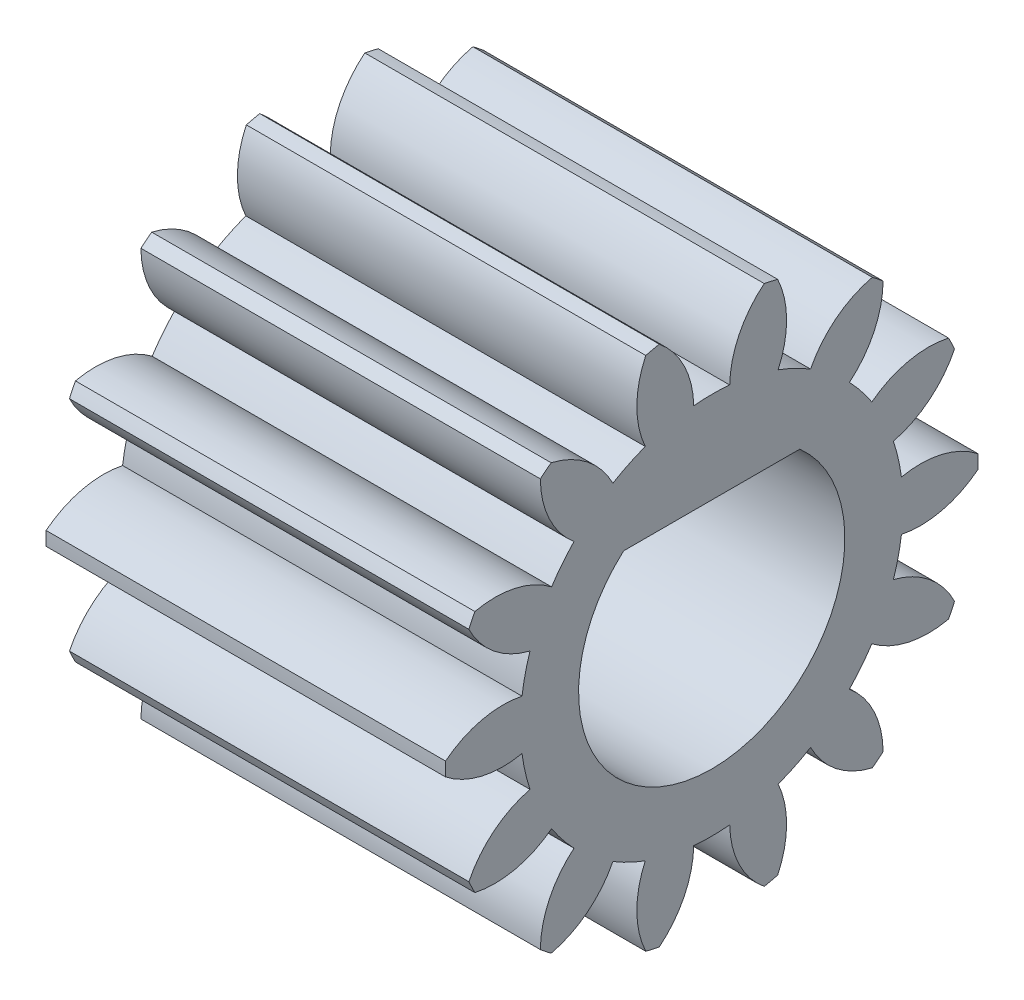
ISO-10303-21;
HEADER;
FILE_DESCRIPTION(('STEP AP214'),'2;1');
FILE_NAME('part.step','',(''),(''),'','','');
FILE_SCHEMA(('AUTOMOTIVE_DESIGN { 1 0 10303 214 1 1 1 1 }'));
ENDSEC;
DATA;
#1=APPLICATION_CONTEXT('core data for automotive mechanical design processes');
#2=APPLICATION_PROTOCOL_DEFINITION('international standard','automotive_design',2000,#1);
#3=PRODUCT_CONTEXT('',#1,'mechanical');
#4=PRODUCT('Part','Part','',(#3));
#5=PRODUCT_RELATED_PRODUCT_CATEGORY('part','',(#4));
#6=PRODUCT_DEFINITION_FORMATION('','',#4);
#7=PRODUCT_DEFINITION_CONTEXT('part definition',#1,'design');
#8=PRODUCT_DEFINITION('design','',#6,#7);
#9=PRODUCT_DEFINITION_SHAPE('','',#8);
#10=(LENGTH_UNIT() NAMED_UNIT(*) SI_UNIT(.MILLI.,.METRE.));
#11=(NAMED_UNIT(*) PLANE_ANGLE_UNIT() SI_UNIT($,.RADIAN.));
#12=(NAMED_UNIT(*) SI_UNIT($,.STERADIAN.) SOLID_ANGLE_UNIT());
#13=UNCERTAINTY_MEASURE_WITH_UNIT(LENGTH_MEASURE(1.E-05),#10,'distance_accuracy_value','');
#14=(GEOMETRIC_REPRESENTATION_CONTEXT(3) GLOBAL_UNCERTAINTY_ASSIGNED_CONTEXT((#13)) GLOBAL_UNIT_ASSIGNED_CONTEXT((#10,
#11,#12)) REPRESENTATION_CONTEXT('',''));
#15=CARTESIAN_POINT('',(0.,0.,0.));
#16=DIRECTION('',(0.,0.,1.));
#17=DIRECTION('',(1.,0.,0.));
#18=AXIS2_PLACEMENT_3D('',#15,#16,#17);
#19=CARTESIAN_POINT('',(6.,0.,0.));
#20=DIRECTION('',(-1.,0.,0.));
#21=DIRECTION('',(0.,0.,1.));
#22=AXIS2_PLACEMENT_3D('',#19,#20,#21);
#23=PLANE('',#22);
#24=CARTESIAN_POINT('',(6.,1.82830084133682,-2.73392360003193));
#25=DIRECTION('',(-1.,0.,0.));
#26=DIRECTION('',(0.,-0.433883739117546,-0.900968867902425));
#27=AXIS2_PLACEMENT_3D('',#24,#25,#26);
#28=CIRCLE('',#27,1.4);
#29=CARTESIAN_POINT('',(6.,2.46068708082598,-1.48488891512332));
#30=VERTEX_POINT('',#29);
#31=CARTESIAN_POINT('',(6.,3.19082838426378,-2.41218038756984));
#32=VERTEX_POINT('',#31);
#33=EDGE_CURVE('E412',#30,#32,#28,.T.);
#34=ORIENTED_EDGE('',*,*,#33,.F.);
#35=CARTESIAN_POINT('',(6.,0.,0.));
#36=DIRECTION('',(-1.,0.,0.));
#37=DIRECTION('',(0.,-0.433883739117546,-0.900968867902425));
#38=AXIS2_PLACEMENT_3D('',#35,#36,#37);
#39=CIRCLE('',#38,2.874);
#40=CARTESIAN_POINT('',(6.,2.69514620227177,-0.99802953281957));
#41=VERTEX_POINT('',#40);
#42=EDGE_CURVE('E416',#41,#30,#39,.T.);
#43=ORIENTED_EDGE('',*,*,#42,.F.);
#44=CARTESIAN_POINT('',(6.,3.27739447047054,0.275150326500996));
#45=DIRECTION('',(-1.,0.,0.));
#46=DIRECTION('',(0.,-0.433883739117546,-0.900968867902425));
#47=AXIS2_PLACEMENT_3D('',#44,#45,#46);
#48=CIRCLE('',#47,1.4);
#49=CARTESIAN_POINT('',(6.,3.87536752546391,-0.990720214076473));
#50=VERTEX_POINT('',#49);
#51=EDGE_CURVE('E414',#50,#41,#48,.T.);
#52=ORIENTED_EDGE('',*,*,#51,.F.);
#53=CARTESIAN_POINT('',(6.,0.,0.));
#54=DIRECTION('',(-1.,0.,0.));
#55=DIRECTION('',(0.,0.,1.));
#56=AXIS2_PLACEMENT_3D('',#53,#54,#55);
#57=CIRCLE('',#56,4.);
#58=CARTESIAN_POINT('',(6.,3.92144288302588,-0.788850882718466));
#59=VERTEX_POINT('',#58);
#60=EDGE_CURVE('E719',#59,#50,#57,.T.);
#61=ORIENTED_EDGE('',*,*,#60,.F.);
#62=CARTESIAN_POINT('',(6.,2.83344713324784,-1.66991004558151));
#63=DIRECTION('',(-1.,0.,0.));
#64=DIRECTION('',(0.,0.,-1.));
#65=AXIS2_PLACEMENT_3D('',#62,#63,#64);
#66=CIRCLE('',#65,1.4);
#67=CARTESIAN_POINT('',(6.,2.86127160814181,-0.270186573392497));
#68=VERTEX_POINT('',#67);
#69=EDGE_CURVE('E697',#68,#59,#66,.T.);
#70=ORIENTED_EDGE('',*,*,#69,.F.);
#71=CARTESIAN_POINT('',(6.,0.,0.));
#72=DIRECTION('',(-1.,0.,0.));
#73=DIRECTION('',(0.,0.,-1.));
#74=AXIS2_PLACEMENT_3D('',#71,#72,#73);
#75=CIRCLE('',#74,2.874);
#76=CARTESIAN_POINT('',(6.,2.86127160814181,0.270186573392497));
#77=VERTEX_POINT('',#76);
#78=EDGE_CURVE('E701',#77,#68,#75,.T.);
#79=ORIENTED_EDGE('',*,*,#78,.F.);
#80=CARTESIAN_POINT('',(6.,2.83344713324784,1.66991004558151));
#81=DIRECTION('',(-1.,0.,0.));
#82=DIRECTION('',(0.,0.,-1.));
#83=AXIS2_PLACEMENT_3D('',#80,#81,#82);
#84=CIRCLE('',#83,1.4);
#85=CARTESIAN_POINT('',(6.,3.92144288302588,0.788850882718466));
#86=VERTEX_POINT('',#85);
#87=EDGE_CURVE('E699',#86,#77,#84,.T.);
#88=ORIENTED_EDGE('',*,*,#87,.F.);
#89=CARTESIAN_POINT('',(6.,3.8753675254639,0.990720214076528));
#90=VERTEX_POINT('',#89);
#91=EDGE_CURVE('E717',#90,#86,#57,.T.);
#92=ORIENTED_EDGE('',*,*,#91,.F.);
#93=CARTESIAN_POINT('',(6.,3.27739447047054,-0.27515032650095));
#94=DIRECTION('',(-1.,0.,0.));
#95=DIRECTION('',(0.,0.433883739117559,-0.900968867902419));
#96=AXIS2_PLACEMENT_3D('',#93,#94,#95);
#97=CIRCLE('',#96,1.4);
#98=CARTESIAN_POINT('',(6.,2.69514620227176,0.998029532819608));
#99=VERTEX_POINT('',#98);
#100=EDGE_CURVE('E675',#99,#90,#97,.T.);
#101=ORIENTED_EDGE('',*,*,#100,.F.);
#102=CARTESIAN_POINT('',(6.,0.,0.));
#103=DIRECTION('',(-1.,0.,0.));
#104=DIRECTION('',(0.,0.433883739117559,-0.900968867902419));
#105=AXIS2_PLACEMENT_3D('',#102,#103,#104);
#106=CIRCLE('',#105,2.874);
#107=CARTESIAN_POINT('',(6.,2.46068708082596,1.48488891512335));
#108=VERTEX_POINT('',#107);
#109=EDGE_CURVE('E679',#108,#99,#106,.T.);
#110=ORIENTED_EDGE('',*,*,#109,.F.);
#111=CARTESIAN_POINT('',(6.,1.82830084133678,2.73392360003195));
#112=DIRECTION('',(-1.,0.,0.));
#113=DIRECTION('',(0.,0.433883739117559,-0.900968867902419));
#114=AXIS2_PLACEMENT_3D('',#111,#112,#113);
#115=CIRCLE('',#114,1.4);
#116=CARTESIAN_POINT('',(6.,3.19082838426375,2.41218038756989));
#117=VERTEX_POINT('',#116);
#118=EDGE_CURVE('E677',#117,#108,#115,.T.);
#119=ORIENTED_EDGE('',*,*,#118,.F.);
#120=CARTESIAN_POINT('',(6.,3.06172810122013,2.57406702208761));
#121=VERTEX_POINT('',#120);
#122=EDGE_CURVE('E801',#121,#117,#57,.T.);
#123=ORIENTED_EDGE('',*,*,#122,.F.);
#124=CARTESIAN_POINT('',(6.,3.07221363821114,1.17410628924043));
#125=DIRECTION('',(-1.,0.,0.));
#126=DIRECTION('',(0.,0.781831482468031,-0.623489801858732));
#127=AXIS2_PLACEMENT_3D('',#124,#125,#126);
#128=CIRCLE('',#127,1.4);
#129=CARTESIAN_POINT('',(6.,1.99521403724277,2.06857365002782));
#130=VERTEX_POINT('',#129);
#131=EDGE_CURVE('E653',#130,#121,#128,.T.);
#132=ORIENTED_EDGE('',*,*,#131,.F.);
#133=CARTESIAN_POINT('',(6.,0.,0.));
#134=DIRECTION('',(-1.,0.,0.));
#135=DIRECTION('',(0.,0.781831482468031,-0.623489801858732));
#136=AXIS2_PLACEMENT_3D('',#133,#134,#135);
#137=CIRCLE('',#136,2.874);
#138=CARTESIAN_POINT('',(6.,1.57273329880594,2.40549079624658));
#139=VERTEX_POINT('',#138);
#140=EDGE_CURVE('E657',#139,#130,#137,.T.);
#141=ORIENTED_EDGE('',*,*,#140,.F.);
#142=CARTESIAN_POINT('',(6.,0.461037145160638,3.25645005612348));
#143=DIRECTION('',(-1.,0.,0.));
#144=DIRECTION('',(0.,0.781831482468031,-0.623489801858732));
#145=AXIS2_PLACEMENT_3D('',#142,#143,#144);
#146=CIRCLE('',#145,1.4);
#147=CARTESIAN_POINT('',(6.,1.82823119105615,3.55774798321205));
#148=VERTEX_POINT('',#147);
#149=EDGE_CURVE('E655',#148,#139,#146,.T.);
#150=ORIENTED_EDGE('',*,*,#149,.F.);
#151=CARTESIAN_POINT('',(6.,1.64167587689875,3.64758828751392));
#152=VERTEX_POINT('',#151);
#153=EDGE_CURVE('E802',#152,#148,#57,.T.);
#154=ORIENTED_EDGE('',*,*,#153,.F.);
#155=CARTESIAN_POINT('',(6.,2.25854321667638,2.39081675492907));
#156=DIRECTION('',(-1.,0.,0.));
#157=DIRECTION('',(0.,0.974927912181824,-0.222520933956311));
#158=AXIS2_PLACEMENT_3D('',#155,#156,#157);
#159=CIRCLE('',#158,1.4);
#160=CARTESIAN_POINT('',(6.,0.900105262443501,2.72941138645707));
#161=VERTEX_POINT('',#160);
#162=EDGE_CURVE('E631',#161,#152,#159,.T.);
#163=ORIENTED_EDGE('',*,*,#162,.F.);
#164=CARTESIAN_POINT('',(6.,0.,0.));
#165=DIRECTION('',(-1.,0.,0.));
#166=DIRECTION('',(0.,0.974927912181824,-0.222520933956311));
#167=AXIS2_PLACEMENT_3D('',#164,#165,#166);
#168=CIRCLE('',#167,2.874);
#169=CARTESIAN_POINT('',(6.,0.373280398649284,2.84965572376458));
#170=VERTEX_POINT('',#169);
#171=EDGE_CURVE('E635',#170,#161,#168,.T.);
#172=ORIENTED_EDGE('',*,*,#171,.F.);
#173=CARTESIAN_POINT('',(6.,-0.997540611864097,3.13399664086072));
#174=DIRECTION('',(-1.,0.,0.));
#175=DIRECTION('',(0.,0.974927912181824,-0.222520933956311));
#176=AXIS2_PLACEMENT_3D('',#173,#174,#175);
#177=CIRCLE('',#176,1.4);
#178=CARTESIAN_POINT('',(6.,0.103530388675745,3.99865995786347));
#179=VERTEX_POINT('',#178);
#180=EDGE_CURVE('E633',#179,#170,#177,.T.);
#181=ORIENTED_EDGE('',*,*,#180,.F.);
#182=CARTESIAN_POINT('',(6.,-0.103530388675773,3.99865995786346));
#183=VERTEX_POINT('',#182);
#184=EDGE_CURVE('E806',#183,#179,#57,.T.);
#185=ORIENTED_EDGE('',*,*,#184,.F.);
#186=CARTESIAN_POINT('',(6.,0.997540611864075,3.13399664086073));
#187=DIRECTION('',(-1.,0.,0.));
#188=DIRECTION('',(0.,0.974927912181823,0.222520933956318));
#189=AXIS2_PLACEMENT_3D('',#186,#187,#188);
#190=CIRCLE('',#189,1.4);
#191=CARTESIAN_POINT('',(6.,-0.373280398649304,2.84965572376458));
#192=VERTEX_POINT('',#191);
#193=EDGE_CURVE('E609',#192,#183,#190,.T.);
#194=ORIENTED_EDGE('',*,*,#193,.F.);
#195=CARTESIAN_POINT('',(6.,0.,0.));
#196=DIRECTION('',(-1.,0.,0.));
#197=DIRECTION('',(0.,0.974927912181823,0.222520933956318));
#198=AXIS2_PLACEMENT_3D('',#195,#196,#197);
#199=CIRCLE('',#198,2.874);
#200=CARTESIAN_POINT('',(6.,-0.90010526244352,2.72941138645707));
#201=VERTEX_POINT('',#200);
#202=EDGE_CURVE('E613',#201,#192,#199,.T.);
#203=ORIENTED_EDGE('',*,*,#202,.F.);
#204=CARTESIAN_POINT('',(6.,-2.2585432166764,2.39081675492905));
#205=DIRECTION('',(-1.,0.,0.));
#206=DIRECTION('',(0.,0.974927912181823,0.222520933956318));
#207=AXIS2_PLACEMENT_3D('',#204,#205,#206);
#208=CIRCLE('',#207,1.4);
#209=CARTESIAN_POINT('',(6.,-1.64167587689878,3.64758828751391));
#210=VERTEX_POINT('',#209);
#211=EDGE_CURVE('E611',#210,#201,#208,.T.);
#212=ORIENTED_EDGE('',*,*,#211,.F.);
#213=CARTESIAN_POINT('',(6.,-1.82823119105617,3.55774798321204));
#214=VERTEX_POINT('',#213);
#215=EDGE_CURVE('E811',#214,#210,#57,.T.);
#216=ORIENTED_EDGE('',*,*,#215,.F.);
#217=CARTESIAN_POINT('',(6.,-0.46103714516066,3.25645005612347));
#218=DIRECTION('',(-1.,0.,0.));
#219=DIRECTION('',(0.,0.781831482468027,0.623489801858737));
#220=AXIS2_PLACEMENT_3D('',#217,#218,#219);
#221=CIRCLE('',#220,1.4);
#222=CARTESIAN_POINT('',(6.,-1.57273329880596,2.40549079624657));
#223=VERTEX_POINT('',#222);
#224=EDGE_CURVE('E587',#223,#214,#221,.T.);
#225=ORIENTED_EDGE('',*,*,#224,.F.);
#226=CARTESIAN_POINT('',(6.,0.,0.));
#227=DIRECTION('',(-1.,0.,0.));
#228=DIRECTION('',(0.,0.781831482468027,0.623489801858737));
#229=AXIS2_PLACEMENT_3D('',#226,#227,#228);
#230=CIRCLE('',#229,2.874);
#231=CARTESIAN_POINT('',(6.,-1.99521403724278,2.06857365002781));
#232=VERTEX_POINT('',#231);
#233=EDGE_CURVE('E591',#232,#223,#230,.T.);
#234=ORIENTED_EDGE('',*,*,#233,.F.);
#235=CARTESIAN_POINT('',(6.,-3.07221363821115,1.17410628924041));
#236=DIRECTION('',(-1.,0.,0.));
#237=DIRECTION('',(0.,0.781831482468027,0.623489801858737));
#238=AXIS2_PLACEMENT_3D('',#235,#236,#237);
#239=CIRCLE('',#238,1.4);
#240=CARTESIAN_POINT('',(6.,-3.06172810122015,2.57406702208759));
#241=VERTEX_POINT('',#240);
#242=EDGE_CURVE('E589',#241,#232,#239,.T.);
#243=ORIENTED_EDGE('',*,*,#242,.F.);
#244=CARTESIAN_POINT('',(6.,-3.19082838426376,2.41218038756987));
#245=VERTEX_POINT('',#244);
#246=EDGE_CURVE('E816',#245,#241,#57,.T.);
#247=ORIENTED_EDGE('',*,*,#246,.F.);
#248=CARTESIAN_POINT('',(6.,-1.8283008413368,2.73392360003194));
#249=DIRECTION('',(-1.,0.,0.));
#250=DIRECTION('',(0.,0.433883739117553,0.900968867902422));
#251=AXIS2_PLACEMENT_3D('',#248,#249,#250);
#252=CIRCLE('',#251,1.4);
#253=CARTESIAN_POINT('',(6.,-2.46068708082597,1.48488891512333));
#254=VERTEX_POINT('',#253);
#255=EDGE_CURVE('E565',#254,#245,#252,.T.);
#256=ORIENTED_EDGE('',*,*,#255,.F.);
#257=CARTESIAN_POINT('',(6.,0.,0.));
#258=DIRECTION('',(-1.,0.,0.));
#259=DIRECTION('',(0.,0.433883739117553,0.900968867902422));
#260=AXIS2_PLACEMENT_3D('',#257,#258,#259);
#261=CIRCLE('',#260,2.874);
#262=CARTESIAN_POINT('',(6.,-2.69514620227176,0.998029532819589));
#263=VERTEX_POINT('',#262);
#264=EDGE_CURVE('E569',#263,#254,#261,.T.);
#265=ORIENTED_EDGE('',*,*,#264,.F.);
#266=CARTESIAN_POINT('',(6.,-3.27739447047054,-0.275150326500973));
#267=DIRECTION('',(-1.,0.,0.));
#268=DIRECTION('',(0.,0.433883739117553,0.900968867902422));
#269=AXIS2_PLACEMENT_3D('',#266,#267,#268);
#270=CIRCLE('',#269,1.4);
#271=CARTESIAN_POINT('',(6.,-3.8753675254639,0.9907202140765));
#272=VERTEX_POINT('',#271);
#273=EDGE_CURVE('E567',#272,#263,#270,.T.);
#274=ORIENTED_EDGE('',*,*,#273,.F.);
#275=CARTESIAN_POINT('',(6.,-3.92144288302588,0.788850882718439));
#276=VERTEX_POINT('',#275);
#277=EDGE_CURVE('E821',#276,#272,#57,.T.);
#278=ORIENTED_EDGE('',*,*,#277,.F.);
#279=CARTESIAN_POINT('',(6.,-2.83344713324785,1.66991004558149));
#280=DIRECTION('',(-1.,0.,0.));
#281=DIRECTION('',(0.,0.,1.));
#282=AXIS2_PLACEMENT_3D('',#279,#280,#281);
#283=CIRCLE('',#282,1.4);
#284=CARTESIAN_POINT('',(6.,-2.86127160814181,0.270186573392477));
#285=VERTEX_POINT('',#284);
#286=EDGE_CURVE('E543',#285,#276,#283,.T.);
#287=ORIENTED_EDGE('',*,*,#286,.F.);
#288=CARTESIAN_POINT('',(6.,0.,0.));
#289=DIRECTION('',(-1.,0.,0.));
#290=DIRECTION('',(0.,0.,1.));
#291=AXIS2_PLACEMENT_3D('',#288,#289,#290);
#292=CIRCLE('',#291,2.874);
#293=CARTESIAN_POINT('',(6.,-2.86127160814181,-0.270186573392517));
#294=VERTEX_POINT('',#293);
#295=EDGE_CURVE('E547',#294,#285,#292,.T.);
#296=ORIENTED_EDGE('',*,*,#295,.F.);
#297=CARTESIAN_POINT('',(6.,-2.83344713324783,-1.66991004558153));
#298=DIRECTION('',(-1.,0.,0.));
#299=DIRECTION('',(0.,0.,1.));
#300=AXIS2_PLACEMENT_3D('',#297,#298,#299);
#301=CIRCLE('',#300,1.4);
#302=CARTESIAN_POINT('',(6.,-3.92144288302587,-0.788850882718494));
#303=VERTEX_POINT('',#302);
#304=EDGE_CURVE('E545',#303,#294,#301,.T.);
#305=ORIENTED_EDGE('',*,*,#304,.F.);
#306=CARTESIAN_POINT('',(6.,-3.87536752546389,-0.990720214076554));
#307=VERTEX_POINT('',#306);
#308=EDGE_CURVE('E826',#307,#303,#57,.T.);
#309=ORIENTED_EDGE('',*,*,#308,.F.);
#310=CARTESIAN_POINT('',(6.,-3.27739447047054,0.275150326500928));
#311=DIRECTION('',(-1.,0.,0.));
#312=DIRECTION('',(0.,-0.433883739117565,0.900968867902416));
#313=AXIS2_PLACEMENT_3D('',#310,#311,#312);
#314=CIRCLE('',#313,1.4);
#315=CARTESIAN_POINT('',(6.,-2.69514620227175,-0.998029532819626));
#316=VERTEX_POINT('',#315);
#317=EDGE_CURVE('E521',#316,#307,#314,.T.);
#318=ORIENTED_EDGE('',*,*,#317,.F.);
#319=CARTESIAN_POINT('',(6.,0.,0.));
#320=DIRECTION('',(-1.,0.,0.));
#321=DIRECTION('',(0.,-0.433883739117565,0.900968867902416));
#322=AXIS2_PLACEMENT_3D('',#319,#320,#321);
#323=CIRCLE('',#322,2.874);
#324=CARTESIAN_POINT('',(6.,-2.46068708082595,-1.48488891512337));
#325=VERTEX_POINT('',#324);
#326=EDGE_CURVE('E525',#325,#316,#323,.T.);
#327=ORIENTED_EDGE('',*,*,#326,.F.);
#328=CARTESIAN_POINT('',(6.,-1.82830084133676,-2.73392360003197));
#329=DIRECTION('',(-1.,0.,0.));
#330=DIRECTION('',(0.,-0.433883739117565,0.900968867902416));
#331=AXIS2_PLACEMENT_3D('',#328,#329,#330);
#332=CIRCLE('',#331,1.4);
#333=CARTESIAN_POINT('',(6.,-3.19082838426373,-2.41218038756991));
#334=VERTEX_POINT('',#333);
#335=EDGE_CURVE('E523',#334,#325,#332,.T.);
#336=ORIENTED_EDGE('',*,*,#335,.F.);
#337=CARTESIAN_POINT('',(6.,-3.06172810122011,-2.57406702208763));
#338=VERTEX_POINT('',#337);
#339=EDGE_CURVE('E831',#338,#334,#57,.T.);
#340=ORIENTED_EDGE('',*,*,#339,.F.);
#341=CARTESIAN_POINT('',(6.,-3.07221363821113,-1.17410628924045));
#342=DIRECTION('',(-1.,0.,0.));
#343=DIRECTION('',(0.,-0.781831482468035,0.623489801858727));
#344=AXIS2_PLACEMENT_3D('',#341,#342,#343);
#345=CIRCLE('',#344,1.4);
#346=CARTESIAN_POINT('',(6.,-1.99521403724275,-2.06857365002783));
#347=VERTEX_POINT('',#346);
#348=EDGE_CURVE('E499',#347,#338,#345,.T.);
#349=ORIENTED_EDGE('',*,*,#348,.F.);
#350=CARTESIAN_POINT('',(6.,0.,0.));
#351=DIRECTION('',(-1.,0.,0.));
#352=DIRECTION('',(0.,-0.781831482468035,0.623489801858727));
#353=AXIS2_PLACEMENT_3D('',#350,#351,#352);
#354=CIRCLE('',#353,2.874);
#355=CARTESIAN_POINT('',(6.,-1.57273329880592,-2.40549079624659));
#356=VERTEX_POINT('',#355);
#357=EDGE_CURVE('E503',#356,#347,#354,.T.);
#358=ORIENTED_EDGE('',*,*,#357,.F.);
#359=CARTESIAN_POINT('',(6.,-0.461037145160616,-3.25645005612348));
#360=DIRECTION('',(-1.,0.,0.));
#361=DIRECTION('',(0.,-0.781831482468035,0.623489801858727));
#362=AXIS2_PLACEMENT_3D('',#359,#360,#361);
#363=CIRCLE('',#362,1.4);
#364=CARTESIAN_POINT('',(6.,-1.82823119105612,-3.55774798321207));
#365=VERTEX_POINT('',#364);
#366=EDGE_CURVE('E501',#365,#356,#363,.T.);
#367=ORIENTED_EDGE('',*,*,#366,.F.);
#368=CARTESIAN_POINT('',(6.,-1.64167587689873,-3.64758828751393));
#369=VERTEX_POINT('',#368);
#370=EDGE_CURVE('E836',#369,#365,#57,.T.);
#371=ORIENTED_EDGE('',*,*,#370,.F.);
#372=CARTESIAN_POINT('',(6.,-2.25854321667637,-2.39081675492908));
#373=DIRECTION('',(-1.,0.,0.));
#374=DIRECTION('',(0.,-0.974927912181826,0.222520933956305));
#375=AXIS2_PLACEMENT_3D('',#372,#373,#374);
#376=CIRCLE('',#375,1.4);
#377=CARTESIAN_POINT('',(6.,-0.900105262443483,-2.72941138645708));
#378=VERTEX_POINT('',#377);
#379=EDGE_CURVE('E477',#378,#369,#376,.T.);
#380=ORIENTED_EDGE('',*,*,#379,.F.);
#381=CARTESIAN_POINT('',(6.,0.,0.));
#382=DIRECTION('',(-1.,0.,0.));
#383=DIRECTION('',(0.,-0.974927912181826,0.222520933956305));
#384=AXIS2_PLACEMENT_3D('',#381,#382,#383);
#385=CIRCLE('',#384,2.874);
#386=CARTESIAN_POINT('',(6.,-0.373280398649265,-2.84965572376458));
#387=VERTEX_POINT('',#386);
#388=EDGE_CURVE('E481',#387,#378,#385,.T.);
#389=ORIENTED_EDGE('',*,*,#388,.F.);
#390=CARTESIAN_POINT('',(6.,0.997540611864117,-3.13399664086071));
#391=DIRECTION('',(-1.,0.,0.));
#392=DIRECTION('',(0.,-0.974927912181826,0.222520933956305));
#393=AXIS2_PLACEMENT_3D('',#390,#391,#392);
#394=CIRCLE('',#393,1.4);
#395=CARTESIAN_POINT('',(6.,-0.103530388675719,-3.99865995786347));
#396=VERTEX_POINT('',#395);
#397=EDGE_CURVE('E479',#396,#387,#394,.T.);
#398=ORIENTED_EDGE('',*,*,#397,.F.);
#399=CARTESIAN_POINT('',(6.,0.103530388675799,-3.99865995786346));
#400=VERTEX_POINT('',#399);
#401=EDGE_CURVE('E841',#400,#396,#57,.T.);
#402=ORIENTED_EDGE('',*,*,#401,.F.);
#403=CARTESIAN_POINT('',(6.,-0.997540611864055,-3.13399664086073));
#404=DIRECTION('',(-1.,0.,0.));
#405=DIRECTION('',(0.,-0.974927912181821,-0.222520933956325));
#406=AXIS2_PLACEMENT_3D('',#403,#404,#405);
#407=CIRCLE('',#406,1.4);
#408=CARTESIAN_POINT('',(6.,0.373280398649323,-2.84965572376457));
#409=VERTEX_POINT('',#408);
#410=EDGE_CURVE('E455',#409,#400,#407,.T.);
#411=ORIENTED_EDGE('',*,*,#410,.F.);
#412=CARTESIAN_POINT('',(6.,0.,0.));
#413=DIRECTION('',(-1.,0.,0.));
#414=DIRECTION('',(0.,-0.974927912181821,-0.222520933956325));
#415=AXIS2_PLACEMENT_3D('',#412,#413,#414);
#416=CIRCLE('',#415,2.874);
#417=CARTESIAN_POINT('',(6.,0.900105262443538,-2.72941138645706));
#418=VERTEX_POINT('',#417);
#419=EDGE_CURVE('E459',#418,#409,#416,.T.);
#420=ORIENTED_EDGE('',*,*,#419,.F.);
#421=CARTESIAN_POINT('',(6.,2.25854321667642,-2.39081675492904));
#422=DIRECTION('',(-1.,0.,0.));
#423=DIRECTION('',(0.,-0.974927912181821,-0.222520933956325));
#424=AXIS2_PLACEMENT_3D('',#421,#422,#423);
#425=CIRCLE('',#424,1.4);
#426=CARTESIAN_POINT('',(6.,1.6416758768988,-3.6475882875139));
#427=VERTEX_POINT('',#426);
#428=EDGE_CURVE('E457',#427,#418,#425,.T.);
#429=ORIENTED_EDGE('',*,*,#428,.F.);
#430=CARTESIAN_POINT('',(6.,1.8282311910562,-3.55774798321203));
#431=VERTEX_POINT('',#430);
#432=EDGE_CURVE('E846',#431,#427,#57,.T.);
#433=ORIENTED_EDGE('',*,*,#432,.F.);
#434=CARTESIAN_POINT('',(6.,0.461037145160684,-3.25645005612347));
#435=DIRECTION('',(-1.,0.,0.));
#436=DIRECTION('',(0.,-0.781831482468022,-0.623489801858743));
#437=AXIS2_PLACEMENT_3D('',#434,#435,#436);
#438=CIRCLE('',#437,1.4);
#439=CARTESIAN_POINT('',(6.,1.57273329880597,-2.40549079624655));
#440=VERTEX_POINT('',#439);
#441=EDGE_CURVE('E433',#440,#431,#438,.T.);
#442=ORIENTED_EDGE('',*,*,#441,.F.);
#443=CARTESIAN_POINT('',(6.,0.,0.));
#444=DIRECTION('',(-1.,0.,0.));
#445=DIRECTION('',(0.,-0.781831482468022,-0.623489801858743));
#446=AXIS2_PLACEMENT_3D('',#443,#444,#445);
#447=CIRCLE('',#446,2.874);
#448=CARTESIAN_POINT('',(6.,1.9952140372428,-2.06857365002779));
#449=VERTEX_POINT('',#448);
#450=EDGE_CURVE('E437',#449,#440,#447,.T.);
#451=ORIENTED_EDGE('',*,*,#450,.F.);
#452=CARTESIAN_POINT('',(6.,3.07221363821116,-1.17410628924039));
#453=DIRECTION('',(-1.,0.,0.));
#454=DIRECTION('',(0.,-0.781831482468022,-0.623489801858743));
#455=AXIS2_PLACEMENT_3D('',#452,#453,#454);
#456=CIRCLE('',#455,1.4);
#457=CARTESIAN_POINT('',(6.,3.06172810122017,-2.57406702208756));
#458=VERTEX_POINT('',#457);
#459=EDGE_CURVE('E435',#458,#449,#456,.T.);
#460=ORIENTED_EDGE('',*,*,#459,.F.);
#461=EDGE_CURVE('E723',#32,#458,#57,.T.);
#462=ORIENTED_EDGE('',*,*,#461,.F.);
#463=EDGE_LOOP('',(#34,#43,#52,#61,#70,#79,#88,#92,#101,#110,#119,#123,#132,#141,#150,#154,#163,
#172,#181,#185,#194,#203,#212,#216,#225,#234,#243,#247,#256,#265,#274,#278,#287,#296,#305,#309,
#318,#327,#336,#340,#349,#358,#367,#371,#380,#389,#398,#402,#411,#420,#429,#433,#442,#451,#460,#462));
#464=FACE_BOUND('',#463,.T.);
#465=CARTESIAN_POINT('',(6.,0.,0.));
#466=DIRECTION('',(-1.,0.,0.));
#467=DIRECTION('',(0.,0.,1.));
#468=AXIS2_PLACEMENT_3D('',#465,#466,#467);
#469=CIRCLE('',#468,2.);
#470=CARTESIAN_POINT('',(6.,1.5,1.3228756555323));
#471=VERTEX_POINT('',#470);
#472=CARTESIAN_POINT('',(6.,1.5,-1.3228756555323));
#473=VERTEX_POINT('',#472);
#474=EDGE_CURVE('E396',#471,#473,#469,.F.);
#475=ORIENTED_EDGE('',*,*,#474,.F.);
#476=DIRECTION('',(0.,0.,1.));
#477=VECTOR('',#476,1.);
#478=CARTESIAN_POINT('',(6.,1.5,0.));
#479=LINE('',#478,#477);
#480=EDGE_CURVE('E392',#473,#471,#479,.T.);
#481=ORIENTED_EDGE('',*,*,#480,.F.);
#482=EDGE_LOOP('',(#475,#481));
#483=FACE_BOUND('',#482,.T.);
#484=ADVANCED_FACE('F32',(#464,#483),#23,.F.);
#485=CARTESIAN_POINT('',(0.,0.,0.));
#486=DIRECTION('',(1.,0.,0.));
#487=DIRECTION('',(0.,0.,-1.));
#488=AXIS2_PLACEMENT_3D('',#485,#486,#487);
#489=PLANE('',#488);
#490=CARTESIAN_POINT('',(0.,1.82830084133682,-2.73392360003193));
#491=DIRECTION('',(-1.,0.,0.));
#492=DIRECTION('',(0.,-0.433883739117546,-0.900968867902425));
#493=AXIS2_PLACEMENT_3D('',#490,#491,#492);
#494=CIRCLE('',#493,1.4);
#495=CARTESIAN_POINT('',(0.,2.46068708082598,-1.48488891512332));
#496=VERTEX_POINT('',#495);
#497=CARTESIAN_POINT('',(0.,3.19082838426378,-2.41218038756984));
#498=VERTEX_POINT('',#497);
#499=EDGE_CURVE('E403',#496,#498,#494,.T.);
#500=ORIENTED_EDGE('',*,*,#499,.T.);
#501=CARTESIAN_POINT('',(0.,0.,0.));
#502=DIRECTION('',(-1.,0.,0.));
#503=DIRECTION('',(0.,0.,1.));
#504=AXIS2_PLACEMENT_3D('',#501,#502,#503);
#505=CIRCLE('',#504,4.);
#506=CARTESIAN_POINT('',(0.,3.06172810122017,-2.57406702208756));
#507=VERTEX_POINT('',#506);
#508=EDGE_CURVE('E718',#498,#507,#505,.T.);
#509=ORIENTED_EDGE('',*,*,#508,.T.);
#510=CARTESIAN_POINT('',(0.,3.07221363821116,-1.17410628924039));
#511=DIRECTION('',(1.,0.,0.));
#512=DIRECTION('',(0.,0.,-1.));
#513=AXIS2_PLACEMENT_3D('',#510,#511,#512);
#514=CIRCLE('',#513,1.4);
#515=CARTESIAN_POINT('',(0.,1.9952140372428,-2.06857365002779));
#516=VERTEX_POINT('',#515);
#517=EDGE_CURVE('E759',#516,#507,#514,.T.);
#518=ORIENTED_EDGE('',*,*,#517,.F.);
#519=CARTESIAN_POINT('',(0.,0.,0.));
#520=DIRECTION('',(-1.,0.,0.));
#521=DIRECTION('',(0.,-0.781831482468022,-0.623489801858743));
#522=AXIS2_PLACEMENT_3D('',#519,#520,#521);
#523=CIRCLE('',#522,2.874);
#524=CARTESIAN_POINT('',(0.,1.57273329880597,-2.40549079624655));
#525=VERTEX_POINT('',#524);
#526=EDGE_CURVE('E430',#516,#525,#523,.T.);
#527=ORIENTED_EDGE('',*,*,#526,.T.);
#528=CARTESIAN_POINT('',(0.,0.461037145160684,-3.25645005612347));
#529=DIRECTION('',(-1.,0.,0.));
#530=DIRECTION('',(0.,-0.781831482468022,-0.623489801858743));
#531=AXIS2_PLACEMENT_3D('',#528,#529,#530);
#532=CIRCLE('',#531,1.4);
#533=CARTESIAN_POINT('',(0.,1.8282311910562,-3.55774798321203));
#534=VERTEX_POINT('',#533);
#535=EDGE_CURVE('E427',#525,#534,#532,.T.);
#536=ORIENTED_EDGE('',*,*,#535,.T.);
#537=CARTESIAN_POINT('',(0.,1.6416758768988,-3.6475882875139));
#538=VERTEX_POINT('',#537);
#539=EDGE_CURVE('E874',#534,#538,#505,.T.);
#540=ORIENTED_EDGE('',*,*,#539,.T.);
#541=CARTESIAN_POINT('',(0.,2.25854321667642,-2.39081675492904));
#542=DIRECTION('',(1.,0.,0.));
#543=DIRECTION('',(0.,0.,-1.));
#544=AXIS2_PLACEMENT_3D('',#541,#542,#543);
#545=CIRCLE('',#544,1.4);
#546=CARTESIAN_POINT('',(0.,0.900105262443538,-2.72941138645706));
#547=VERTEX_POINT('',#546);
#548=EDGE_CURVE('E756',#547,#538,#545,.T.);
#549=ORIENTED_EDGE('',*,*,#548,.F.);
#550=CARTESIAN_POINT('',(0.,0.,0.));
#551=DIRECTION('',(-1.,0.,0.));
#552=DIRECTION('',(0.,-0.974927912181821,-0.222520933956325));
#553=AXIS2_PLACEMENT_3D('',#550,#551,#552);
#554=CIRCLE('',#553,2.874);
#555=CARTESIAN_POINT('',(0.,0.373280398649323,-2.84965572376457));
#556=VERTEX_POINT('',#555);
#557=EDGE_CURVE('E452',#547,#556,#554,.T.);
#558=ORIENTED_EDGE('',*,*,#557,.T.);
#559=CARTESIAN_POINT('',(0.,-0.997540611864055,-3.13399664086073));
#560=DIRECTION('',(-1.,0.,0.));
#561=DIRECTION('',(0.,-0.974927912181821,-0.222520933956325));
#562=AXIS2_PLACEMENT_3D('',#559,#560,#561);
#563=CIRCLE('',#562,1.4);
#564=CARTESIAN_POINT('',(0.,0.103530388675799,-3.99865995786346));
#565=VERTEX_POINT('',#564);
#566=EDGE_CURVE('E449',#556,#565,#563,.T.);
#567=ORIENTED_EDGE('',*,*,#566,.T.);
#568=CARTESIAN_POINT('',(0.,-0.103530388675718,-3.99865995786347));
#569=VERTEX_POINT('',#568);
#570=EDGE_CURVE('E876',#565,#569,#505,.T.);
#571=ORIENTED_EDGE('',*,*,#570,.T.);
#572=CARTESIAN_POINT('',(0.,0.997540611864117,-3.13399664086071));
#573=DIRECTION('',(1.,0.,0.));
#574=DIRECTION('',(0.,0.,-1.));
#575=AXIS2_PLACEMENT_3D('',#572,#573,#574);
#576=CIRCLE('',#575,1.4);
#577=CARTESIAN_POINT('',(0.,-0.373280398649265,-2.84965572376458));
#578=VERTEX_POINT('',#577);
#579=EDGE_CURVE('E753',#578,#569,#576,.T.);
#580=ORIENTED_EDGE('',*,*,#579,.F.);
#581=CARTESIAN_POINT('',(0.,0.,0.));
#582=DIRECTION('',(-1.,0.,0.));
#583=DIRECTION('',(0.,-0.974927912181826,0.222520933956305));
#584=AXIS2_PLACEMENT_3D('',#581,#582,#583);
#585=CIRCLE('',#584,2.874);
#586=CARTESIAN_POINT('',(0.,-0.900105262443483,-2.72941138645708));
#587=VERTEX_POINT('',#586);
#588=EDGE_CURVE('E474',#578,#587,#585,.T.);
#589=ORIENTED_EDGE('',*,*,#588,.T.);
#590=CARTESIAN_POINT('',(0.,-2.25854321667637,-2.39081675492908));
#591=DIRECTION('',(-1.,0.,0.));
#592=DIRECTION('',(0.,-0.974927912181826,0.222520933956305));
#593=AXIS2_PLACEMENT_3D('',#590,#591,#592);
#594=CIRCLE('',#593,1.4);
#595=CARTESIAN_POINT('',(0.,-1.64167587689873,-3.64758828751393));
#596=VERTEX_POINT('',#595);
#597=EDGE_CURVE('E471',#587,#596,#594,.T.);
#598=ORIENTED_EDGE('',*,*,#597,.T.);
#599=CARTESIAN_POINT('',(0.,-1.82823119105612,-3.55774798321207));
#600=VERTEX_POINT('',#599);
#601=EDGE_CURVE('E877',#596,#600,#505,.T.);
#602=ORIENTED_EDGE('',*,*,#601,.T.);
#603=CARTESIAN_POINT('',(0.,-0.461037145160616,-3.25645005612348));
#604=DIRECTION('',(1.,0.,0.));
#605=DIRECTION('',(0.,0.,-1.));
#606=AXIS2_PLACEMENT_3D('',#603,#604,#605);
#607=CIRCLE('',#606,1.4);
#608=CARTESIAN_POINT('',(0.,-1.57273329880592,-2.40549079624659));
#609=VERTEX_POINT('',#608);
#610=EDGE_CURVE('E750',#609,#600,#607,.T.);
#611=ORIENTED_EDGE('',*,*,#610,.F.);
#612=CARTESIAN_POINT('',(0.,0.,0.));
#613=DIRECTION('',(-1.,0.,0.));
#614=DIRECTION('',(0.,-0.781831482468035,0.623489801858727));
#615=AXIS2_PLACEMENT_3D('',#612,#613,#614);
#616=CIRCLE('',#615,2.874);
#617=CARTESIAN_POINT('',(0.,-1.99521403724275,-2.06857365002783));
#618=VERTEX_POINT('',#617);
#619=EDGE_CURVE('E496',#609,#618,#616,.T.);
#620=ORIENTED_EDGE('',*,*,#619,.T.);
#621=CARTESIAN_POINT('',(0.,-3.07221363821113,-1.17410628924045));
#622=DIRECTION('',(-1.,0.,0.));
#623=DIRECTION('',(0.,-0.781831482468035,0.623489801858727));
#624=AXIS2_PLACEMENT_3D('',#621,#622,#623);
#625=CIRCLE('',#624,1.4);
#626=CARTESIAN_POINT('',(0.,-3.06172810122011,-2.57406702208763));
#627=VERTEX_POINT('',#626);
#628=EDGE_CURVE('E493',#618,#627,#625,.T.);
#629=ORIENTED_EDGE('',*,*,#628,.T.);
#630=CARTESIAN_POINT('',(0.,-3.19082838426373,-2.41218038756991));
#631=VERTEX_POINT('',#630);
#632=EDGE_CURVE('E880',#627,#631,#505,.T.);
#633=ORIENTED_EDGE('',*,*,#632,.T.);
#634=CARTESIAN_POINT('',(0.,-1.82830084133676,-2.73392360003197));
#635=DIRECTION('',(1.,0.,0.));
#636=DIRECTION('',(0.,0.,-1.));
#637=AXIS2_PLACEMENT_3D('',#634,#635,#636);
#638=CIRCLE('',#637,1.4);
#639=CARTESIAN_POINT('',(0.,-2.46068708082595,-1.48488891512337));
#640=VERTEX_POINT('',#639);
#641=EDGE_CURVE('E747',#640,#631,#638,.T.);
#642=ORIENTED_EDGE('',*,*,#641,.F.);
#643=CARTESIAN_POINT('',(0.,0.,0.));
#644=DIRECTION('',(-1.,0.,0.));
#645=DIRECTION('',(0.,-0.433883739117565,0.900968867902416));
#646=AXIS2_PLACEMENT_3D('',#643,#644,#645);
#647=CIRCLE('',#646,2.874);
#648=CARTESIAN_POINT('',(0.,-2.69514620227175,-0.998029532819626));
#649=VERTEX_POINT('',#648);
#650=EDGE_CURVE('E518',#640,#649,#647,.T.);
#651=ORIENTED_EDGE('',*,*,#650,.T.);
#652=CARTESIAN_POINT('',(0.,-3.27739447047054,0.275150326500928));
#653=DIRECTION('',(-1.,0.,0.));
#654=DIRECTION('',(0.,-0.433883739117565,0.900968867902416));
#655=AXIS2_PLACEMENT_3D('',#652,#653,#654);
#656=CIRCLE('',#655,1.4);
#657=CARTESIAN_POINT('',(0.,-3.87536752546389,-0.990720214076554));
#658=VERTEX_POINT('',#657);
#659=EDGE_CURVE('E515',#649,#658,#656,.T.);
#660=ORIENTED_EDGE('',*,*,#659,.T.);
#661=CARTESIAN_POINT('',(0.,-3.92144288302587,-0.788850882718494));
#662=VERTEX_POINT('',#661);
#663=EDGE_CURVE('E883',#658,#662,#505,.T.);
#664=ORIENTED_EDGE('',*,*,#663,.T.);
#665=CARTESIAN_POINT('',(0.,-2.83344713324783,-1.66991004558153));
#666=DIRECTION('',(1.,0.,0.));
#667=DIRECTION('',(0.,0.,-1.));
#668=AXIS2_PLACEMENT_3D('',#665,#666,#667);
#669=CIRCLE('',#668,1.4);
#670=CARTESIAN_POINT('',(0.,-2.86127160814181,-0.270186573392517));
#671=VERTEX_POINT('',#670);
#672=EDGE_CURVE('E744',#671,#662,#669,.T.);
#673=ORIENTED_EDGE('',*,*,#672,.F.);
#674=CARTESIAN_POINT('',(0.,0.,0.));
#675=DIRECTION('',(-1.,0.,0.));
#676=DIRECTION('',(0.,0.,1.));
#677=AXIS2_PLACEMENT_3D('',#674,#675,#676);
#678=CIRCLE('',#677,2.874);
#679=CARTESIAN_POINT('',(0.,-2.86127160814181,0.270186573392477));
#680=VERTEX_POINT('',#679);
#681=EDGE_CURVE('E540',#671,#680,#678,.T.);
#682=ORIENTED_EDGE('',*,*,#681,.T.);
#683=CARTESIAN_POINT('',(0.,-2.83344713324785,1.66991004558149));
#684=DIRECTION('',(-1.,0.,0.));
#685=DIRECTION('',(0.,0.,1.));
#686=AXIS2_PLACEMENT_3D('',#683,#684,#685);
#687=CIRCLE('',#686,1.4);
#688=CARTESIAN_POINT('',(0.,-3.92144288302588,0.788850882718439));
#689=VERTEX_POINT('',#688);
#690=EDGE_CURVE('E537',#680,#689,#687,.T.);
#691=ORIENTED_EDGE('',*,*,#690,.T.);
#692=CARTESIAN_POINT('',(0.,-3.8753675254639,0.9907202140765));
#693=VERTEX_POINT('',#692);
#694=EDGE_CURVE('E886',#689,#693,#505,.T.);
#695=ORIENTED_EDGE('',*,*,#694,.T.);
#696=CARTESIAN_POINT('',(0.,-3.27739447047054,-0.275150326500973));
#697=DIRECTION('',(1.,0.,0.));
#698=DIRECTION('',(0.,0.,-1.));
#699=AXIS2_PLACEMENT_3D('',#696,#697,#698);
#700=CIRCLE('',#699,1.4);
#701=CARTESIAN_POINT('',(0.,-2.69514620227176,0.998029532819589));
#702=VERTEX_POINT('',#701);
#703=EDGE_CURVE('E741',#702,#693,#700,.T.);
#704=ORIENTED_EDGE('',*,*,#703,.F.);
#705=CARTESIAN_POINT('',(0.,0.,0.));
#706=DIRECTION('',(-1.,0.,0.));
#707=DIRECTION('',(0.,0.433883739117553,0.900968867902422));
#708=AXIS2_PLACEMENT_3D('',#705,#706,#707);
#709=CIRCLE('',#708,2.874);
#710=CARTESIAN_POINT('',(0.,-2.46068708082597,1.48488891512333));
#711=VERTEX_POINT('',#710);
#712=EDGE_CURVE('E562',#702,#711,#709,.T.);
#713=ORIENTED_EDGE('',*,*,#712,.T.);
#714=CARTESIAN_POINT('',(0.,-1.8283008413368,2.73392360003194));
#715=DIRECTION('',(-1.,0.,0.));
#716=DIRECTION('',(0.,0.433883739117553,0.900968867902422));
#717=AXIS2_PLACEMENT_3D('',#714,#715,#716);
#718=CIRCLE('',#717,1.4);
#719=CARTESIAN_POINT('',(0.,-3.19082838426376,2.41218038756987));
#720=VERTEX_POINT('',#719);
#721=EDGE_CURVE('E559',#711,#720,#718,.T.);
#722=ORIENTED_EDGE('',*,*,#721,.T.);
#723=CARTESIAN_POINT('',(0.,-3.06172810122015,2.57406702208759));
#724=VERTEX_POINT('',#723);
#725=EDGE_CURVE('E889',#720,#724,#505,.T.);
#726=ORIENTED_EDGE('',*,*,#725,.T.);
#727=CARTESIAN_POINT('',(0.,-3.07221363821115,1.17410628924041));
#728=DIRECTION('',(1.,0.,0.));
#729=DIRECTION('',(0.,0.,-1.));
#730=AXIS2_PLACEMENT_3D('',#727,#728,#729);
#731=CIRCLE('',#730,1.4);
#732=CARTESIAN_POINT('',(0.,-1.99521403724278,2.06857365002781));
#733=VERTEX_POINT('',#732);
#734=EDGE_CURVE('E738',#733,#724,#731,.T.);
#735=ORIENTED_EDGE('',*,*,#734,.F.);
#736=CARTESIAN_POINT('',(0.,0.,0.));
#737=DIRECTION('',(-1.,0.,0.));
#738=DIRECTION('',(0.,0.781831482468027,0.623489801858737));
#739=AXIS2_PLACEMENT_3D('',#736,#737,#738);
#740=CIRCLE('',#739,2.874);
#741=CARTESIAN_POINT('',(0.,-1.57273329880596,2.40549079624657));
#742=VERTEX_POINT('',#741);
#743=EDGE_CURVE('E584',#733,#742,#740,.T.);
#744=ORIENTED_EDGE('',*,*,#743,.T.);
#745=CARTESIAN_POINT('',(0.,-0.46103714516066,3.25645005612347));
#746=DIRECTION('',(-1.,0.,0.));
#747=DIRECTION('',(0.,0.781831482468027,0.623489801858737));
#748=AXIS2_PLACEMENT_3D('',#745,#746,#747);
#749=CIRCLE('',#748,1.4);
#750=CARTESIAN_POINT('',(0.,-1.82823119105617,3.55774798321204));
#751=VERTEX_POINT('',#750);
#752=EDGE_CURVE('E581',#742,#751,#749,.T.);
#753=ORIENTED_EDGE('',*,*,#752,.T.);
#754=CARTESIAN_POINT('',(0.,-1.64167587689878,3.64758828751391));
#755=VERTEX_POINT('',#754);
#756=EDGE_CURVE('E892',#751,#755,#505,.T.);
#757=ORIENTED_EDGE('',*,*,#756,.T.);
#758=CARTESIAN_POINT('',(0.,-2.2585432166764,2.39081675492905));
#759=DIRECTION('',(1.,0.,0.));
#760=DIRECTION('',(0.,0.,-1.));
#761=AXIS2_PLACEMENT_3D('',#758,#759,#760);
#762=CIRCLE('',#761,1.4);
#763=CARTESIAN_POINT('',(0.,-0.90010526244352,2.72941138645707));
#764=VERTEX_POINT('',#763);
#765=EDGE_CURVE('E735',#764,#755,#762,.T.);
#766=ORIENTED_EDGE('',*,*,#765,.F.);
#767=CARTESIAN_POINT('',(0.,0.,0.));
#768=DIRECTION('',(-1.,0.,0.));
#769=DIRECTION('',(0.,0.974927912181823,0.222520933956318));
#770=AXIS2_PLACEMENT_3D('',#767,#768,#769);
#771=CIRCLE('',#770,2.874);
#772=CARTESIAN_POINT('',(0.,-0.373280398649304,2.84965572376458));
#773=VERTEX_POINT('',#772);
#774=EDGE_CURVE('E606',#764,#773,#771,.T.);
#775=ORIENTED_EDGE('',*,*,#774,.T.);
#776=CARTESIAN_POINT('',(0.,0.997540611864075,3.13399664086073));
#777=DIRECTION('',(-1.,0.,0.));
#778=DIRECTION('',(0.,0.974927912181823,0.222520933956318));
#779=AXIS2_PLACEMENT_3D('',#776,#777,#778);
#780=CIRCLE('',#779,1.4);
#781=CARTESIAN_POINT('',(0.,-0.103530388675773,3.99865995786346));
#782=VERTEX_POINT('',#781);
#783=EDGE_CURVE('E603',#773,#782,#780,.T.);
#784=ORIENTED_EDGE('',*,*,#783,.T.);
#785=CARTESIAN_POINT('',(0.,0.103530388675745,3.99865995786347));
#786=VERTEX_POINT('',#785);
#787=EDGE_CURVE('E895',#782,#786,#505,.T.);
#788=ORIENTED_EDGE('',*,*,#787,.T.);
#789=CARTESIAN_POINT('',(0.,-0.997540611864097,3.13399664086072));
#790=DIRECTION('',(1.,0.,0.));
#791=DIRECTION('',(0.,0.,-1.));
#792=AXIS2_PLACEMENT_3D('',#789,#790,#791);
#793=CIRCLE('',#792,1.4);
#794=CARTESIAN_POINT('',(0.,0.373280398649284,2.84965572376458));
#795=VERTEX_POINT('',#794);
#796=EDGE_CURVE('E732',#795,#786,#793,.T.);
#797=ORIENTED_EDGE('',*,*,#796,.F.);
#798=CARTESIAN_POINT('',(0.,0.,0.));
#799=DIRECTION('',(-1.,0.,0.));
#800=DIRECTION('',(0.,0.974927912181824,-0.222520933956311));
#801=AXIS2_PLACEMENT_3D('',#798,#799,#800);
#802=CIRCLE('',#801,2.874);
#803=CARTESIAN_POINT('',(0.,0.900105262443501,2.72941138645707));
#804=VERTEX_POINT('',#803);
#805=EDGE_CURVE('E628',#795,#804,#802,.T.);
#806=ORIENTED_EDGE('',*,*,#805,.T.);
#807=CARTESIAN_POINT('',(0.,2.25854321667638,2.39081675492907));
#808=DIRECTION('',(-1.,0.,0.));
#809=DIRECTION('',(0.,0.974927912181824,-0.222520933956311));
#810=AXIS2_PLACEMENT_3D('',#807,#808,#809);
#811=CIRCLE('',#810,1.4);
#812=CARTESIAN_POINT('',(0.,1.64167587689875,3.64758828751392));
#813=VERTEX_POINT('',#812);
#814=EDGE_CURVE('E625',#804,#813,#811,.T.);
#815=ORIENTED_EDGE('',*,*,#814,.T.);
#816=CARTESIAN_POINT('',(0.,1.82823119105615,3.55774798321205));
#817=VERTEX_POINT('',#816);
#818=EDGE_CURVE('E898',#813,#817,#505,.T.);
#819=ORIENTED_EDGE('',*,*,#818,.T.);
#820=CARTESIAN_POINT('',(0.,0.461037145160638,3.25645005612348));
#821=DIRECTION('',(1.,0.,0.));
#822=DIRECTION('',(0.,0.,-1.));
#823=AXIS2_PLACEMENT_3D('',#820,#821,#822);
#824=CIRCLE('',#823,1.4);
#825=CARTESIAN_POINT('',(0.,1.57273329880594,2.40549079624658));
#826=VERTEX_POINT('',#825);
#827=EDGE_CURVE('E729',#826,#817,#824,.T.);
#828=ORIENTED_EDGE('',*,*,#827,.F.);
#829=CARTESIAN_POINT('',(0.,0.,0.));
#830=DIRECTION('',(-1.,0.,0.));
#831=DIRECTION('',(0.,0.781831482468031,-0.623489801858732));
#832=AXIS2_PLACEMENT_3D('',#829,#830,#831);
#833=CIRCLE('',#832,2.874);
#834=CARTESIAN_POINT('',(0.,1.99521403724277,2.06857365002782));
#835=VERTEX_POINT('',#834);
#836=EDGE_CURVE('E650',#826,#835,#833,.T.);
#837=ORIENTED_EDGE('',*,*,#836,.T.);
#838=CARTESIAN_POINT('',(0.,3.07221363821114,1.17410628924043));
#839=DIRECTION('',(-1.,0.,0.));
#840=DIRECTION('',(0.,0.781831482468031,-0.623489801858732));
#841=AXIS2_PLACEMENT_3D('',#838,#839,#840);
#842=CIRCLE('',#841,1.4);
#843=CARTESIAN_POINT('',(0.,3.06172810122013,2.57406702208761));
#844=VERTEX_POINT('',#843);
#845=EDGE_CURVE('E647',#835,#844,#842,.T.);
#846=ORIENTED_EDGE('',*,*,#845,.T.);
#847=CARTESIAN_POINT('',(0.,3.19082838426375,2.41218038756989));
#848=VERTEX_POINT('',#847);
#849=EDGE_CURVE('E901',#844,#848,#505,.T.);
#850=ORIENTED_EDGE('',*,*,#849,.T.);
#851=CARTESIAN_POINT('',(0.,1.82830084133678,2.73392360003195));
#852=DIRECTION('',(1.,0.,0.));
#853=DIRECTION('',(0.,0.,-1.));
#854=AXIS2_PLACEMENT_3D('',#851,#852,#853);
#855=CIRCLE('',#854,1.4);
#856=CARTESIAN_POINT('',(0.,2.46068708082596,1.48488891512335));
#857=VERTEX_POINT('',#856);
#858=EDGE_CURVE('E726',#857,#848,#855,.T.);
#859=ORIENTED_EDGE('',*,*,#858,.F.);
#860=CARTESIAN_POINT('',(0.,0.,0.));
#861=DIRECTION('',(-1.,0.,0.));
#862=DIRECTION('',(0.,0.433883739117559,-0.900968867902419));
#863=AXIS2_PLACEMENT_3D('',#860,#861,#862);
#864=CIRCLE('',#863,2.874);
#865=CARTESIAN_POINT('',(0.,2.69514620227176,0.998029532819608));
#866=VERTEX_POINT('',#865);
#867=EDGE_CURVE('E672',#857,#866,#864,.T.);
#868=ORIENTED_EDGE('',*,*,#867,.T.);
#869=CARTESIAN_POINT('',(0.,3.27739447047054,-0.27515032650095));
#870=DIRECTION('',(-1.,0.,0.));
#871=DIRECTION('',(0.,0.433883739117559,-0.900968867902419));
#872=AXIS2_PLACEMENT_3D('',#869,#870,#871);
#873=CIRCLE('',#872,1.4);
#874=CARTESIAN_POINT('',(0.,3.8753675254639,0.990720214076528));
#875=VERTEX_POINT('',#874);
#876=EDGE_CURVE('E669',#866,#875,#873,.T.);
#877=ORIENTED_EDGE('',*,*,#876,.T.);
#878=CARTESIAN_POINT('',(0.,3.92144288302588,0.788850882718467));
#879=VERTEX_POINT('',#878);
#880=EDGE_CURVE('E713',#875,#879,#505,.T.);
#881=ORIENTED_EDGE('',*,*,#880,.T.);
#882=CARTESIAN_POINT('',(0.,2.83344713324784,1.66991004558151));
#883=DIRECTION('',(1.,0.,0.));
#884=DIRECTION('',(0.,0.,-1.));
#885=AXIS2_PLACEMENT_3D('',#882,#883,#884);
#886=CIRCLE('',#885,1.4);
#887=CARTESIAN_POINT('',(0.,2.86127160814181,0.270186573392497));
#888=VERTEX_POINT('',#887);
#889=EDGE_CURVE('E722',#888,#879,#886,.T.);
#890=ORIENTED_EDGE('',*,*,#889,.F.);
#891=CARTESIAN_POINT('',(0.,0.,0.));
#892=DIRECTION('',(-1.,0.,0.));
#893=DIRECTION('',(0.,0.,-1.));
#894=AXIS2_PLACEMENT_3D('',#891,#892,#893);
#895=CIRCLE('',#894,2.874);
#896=CARTESIAN_POINT('',(0.,2.86127160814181,-0.270186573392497));
#897=VERTEX_POINT('',#896);
#898=EDGE_CURVE('E694',#888,#897,#895,.T.);
#899=ORIENTED_EDGE('',*,*,#898,.T.);
#900=CARTESIAN_POINT('',(0.,2.83344713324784,-1.66991004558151));
#901=DIRECTION('',(-1.,0.,0.));
#902=DIRECTION('',(0.,0.,-1.));
#903=AXIS2_PLACEMENT_3D('',#900,#901,#902);
#904=CIRCLE('',#903,1.4);
#905=CARTESIAN_POINT('',(0.,3.92144288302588,-0.788850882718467));
#906=VERTEX_POINT('',#905);
#907=EDGE_CURVE('E691',#897,#906,#904,.T.);
#908=ORIENTED_EDGE('',*,*,#907,.T.);
#909=CARTESIAN_POINT('',(0.,3.87536752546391,-0.990720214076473));
#910=VERTEX_POINT('',#909);
#911=EDGE_CURVE('E714',#906,#910,#505,.T.);
#912=ORIENTED_EDGE('',*,*,#911,.T.);
#913=CARTESIAN_POINT('',(0.,3.27739447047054,0.275150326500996));
#914=DIRECTION('',(1.,0.,0.));
#915=DIRECTION('',(0.,0.,-1.));
#916=AXIS2_PLACEMENT_3D('',#913,#914,#915);
#917=CIRCLE('',#916,1.4);
#918=CARTESIAN_POINT('',(0.,2.69514620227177,-0.99802953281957));
#919=VERTEX_POINT('',#918);
#920=EDGE_CURVE('E762',#919,#910,#917,.T.);
#921=ORIENTED_EDGE('',*,*,#920,.F.);
#922=CARTESIAN_POINT('',(0.,0.,0.));
#923=DIRECTION('',(-1.,0.,0.));
#924=DIRECTION('',(0.,-0.433883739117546,-0.900968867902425));
#925=AXIS2_PLACEMENT_3D('',#922,#923,#924);
#926=CIRCLE('',#925,2.874);
#927=EDGE_CURVE('E406',#919,#496,#926,.T.);
#928=ORIENTED_EDGE('',*,*,#927,.T.);
#929=EDGE_LOOP('',(#500,#509,#518,#527,#536,#540,#549,#558,#567,#571,#580,#589,#598,#602,#611,
#620,#629,#633,#642,#651,#660,#664,#673,#682,#691,#695,#704,#713,#722,#726,#735,#744,#753,#757,
#766,#775,#784,#788,#797,#806,#815,#819,#828,#837,#846,#850,#859,#868,#877,#881,#890,#899,#908,
#912,#921,#928));
#930=FACE_BOUND('',#929,.T.);
#931=CARTESIAN_POINT('',(0.,0.,0.));
#932=DIRECTION('',(1.,0.,0.));
#933=DIRECTION('',(0.,0.,-1.));
#934=AXIS2_PLACEMENT_3D('',#931,#932,#933);
#935=CIRCLE('',#934,2.);
#936=CARTESIAN_POINT('',(0.,1.5,-1.3228756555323));
#937=VERTEX_POINT('',#936);
#938=CARTESIAN_POINT('',(0.,1.5,1.3228756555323));
#939=VERTEX_POINT('',#938);
#940=EDGE_CURVE('E11',#937,#939,#935,.F.);
#941=ORIENTED_EDGE('',*,*,#940,.F.);
#942=DIRECTION('',(0.,0.,-1.));
#943=VECTOR('',#942,1.);
#944=CARTESIAN_POINT('',(0.,1.5,0.));
#945=LINE('',#944,#943);
#946=EDGE_CURVE('E39',#939,#937,#945,.T.);
#947=ORIENTED_EDGE('',*,*,#946,.F.);
#948=EDGE_LOOP('',(#941,#947));
#949=FACE_BOUND('',#948,.T.);
#950=ADVANCED_FACE('F764',(#930,#949),#489,.F.);
#951=CARTESIAN_POINT('',(-10.,0.,0.));
#952=DIRECTION('',(-1.,0.,0.));
#953=DIRECTION('',(0.,0.,1.));
#954=AXIS2_PLACEMENT_3D('',#951,#952,#953);
#955=CYLINDRICAL_SURFACE('',#954,4.);
#956=DIRECTION('',(-1.,0.,0.));
#957=VECTOR('',#956,1.);
#958=CARTESIAN_POINT('',(3.,3.19082838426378,-2.41218038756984));
#959=LINE('',#958,#957);
#960=EDGE_CURVE('E425',#32,#498,#959,.T.);
#961=ORIENTED_EDGE('',*,*,#960,.F.);
#962=ORIENTED_EDGE('',*,*,#461,.T.);
#963=DIRECTION('',(-1.,0.,0.));
#964=VECTOR('',#963,1.);
#965=CARTESIAN_POINT('',(3.,3.06172810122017,-2.57406702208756));
#966=LINE('',#965,#964);
#967=EDGE_CURVE('E444',#507,#458,#966,.F.);
#968=ORIENTED_EDGE('',*,*,#967,.F.);
#969=ORIENTED_EDGE('',*,*,#508,.F.);
#970=EDGE_LOOP('',(#961,#962,#968,#969));
#971=FACE_BOUND('',#970,.T.);
#972=ADVANCED_FACE('F766',(#971),#955,.T.);
#973=DIRECTION('',(-1.,0.,0.));
#974=VECTOR('',#973,1.);
#975=CARTESIAN_POINT('',(3.,3.87536752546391,-0.990720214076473));
#976=LINE('',#975,#974);
#977=EDGE_CURVE('E423',#910,#50,#976,.F.);
#978=ORIENTED_EDGE('',*,*,#977,.F.);
#979=ORIENTED_EDGE('',*,*,#911,.F.);
#980=DIRECTION('',(-1.,0.,0.));
#981=VECTOR('',#980,1.);
#982=CARTESIAN_POINT('',(3.,3.92144288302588,-0.788850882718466));
#983=LINE('',#982,#981);
#984=EDGE_CURVE('E711',#59,#906,#983,.T.);
#985=ORIENTED_EDGE('',*,*,#984,.F.);
#986=ORIENTED_EDGE('',*,*,#60,.T.);
#987=EDGE_LOOP('',(#978,#979,#985,#986));
#988=FACE_BOUND('',#987,.T.);
#989=ADVANCED_FACE('F773',(#988),#955,.T.);
#990=DIRECTION('',(-1.,0.,0.));
#991=VECTOR('',#990,1.);
#992=CARTESIAN_POINT('',(3.,1.8282311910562,-3.55774798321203));
#993=LINE('',#992,#991);
#994=EDGE_CURVE('E447',#431,#534,#993,.T.);
#995=ORIENTED_EDGE('',*,*,#994,.F.);
#996=ORIENTED_EDGE('',*,*,#432,.T.);
#997=DIRECTION('',(-1.,0.,0.));
#998=VECTOR('',#997,1.);
#999=CARTESIAN_POINT('',(3.,1.6416758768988,-3.6475882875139));
#1000=LINE('',#999,#998);
#1001=EDGE_CURVE('E466',#538,#427,#1000,.F.);
#1002=ORIENTED_EDGE('',*,*,#1001,.F.);
#1003=ORIENTED_EDGE('',*,*,#539,.F.);
#1004=EDGE_LOOP('',(#995,#996,#1002,#1003));
#1005=FACE_BOUND('',#1004,.T.);
#1006=ADVANCED_FACE('F875',(#1005),#955,.T.);
#1007=DIRECTION('',(-1.,0.,0.));
#1008=VECTOR('',#1007,1.);
#1009=CARTESIAN_POINT('',(3.,0.103530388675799,-3.99865995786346));
#1010=LINE('',#1009,#1008);
#1011=EDGE_CURVE('E469',#400,#565,#1010,.T.);
#1012=ORIENTED_EDGE('',*,*,#1011,.F.);
#1013=ORIENTED_EDGE('',*,*,#401,.T.);
#1014=DIRECTION('',(-1.,0.,0.));
#1015=VECTOR('',#1014,1.);
#1016=CARTESIAN_POINT('',(3.,-0.103530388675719,-3.99865995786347));
#1017=LINE('',#1016,#1015);
#1018=EDGE_CURVE('E488',#569,#396,#1017,.F.);
#1019=ORIENTED_EDGE('',*,*,#1018,.F.);
#1020=ORIENTED_EDGE('',*,*,#570,.F.);
#1021=EDGE_LOOP('',(#1012,#1013,#1019,#1020));
#1022=FACE_BOUND('',#1021,.T.);
#1023=ADVANCED_FACE('F1363',(#1022),#955,.T.);
#1024=DIRECTION('',(-1.,0.,0.));
#1025=VECTOR('',#1024,1.);
#1026=CARTESIAN_POINT('',(3.,-1.64167587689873,-3.64758828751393));
#1027=LINE('',#1026,#1025);
#1028=EDGE_CURVE('E491',#369,#596,#1027,.T.);
#1029=ORIENTED_EDGE('',*,*,#1028,.F.);
#1030=ORIENTED_EDGE('',*,*,#370,.T.);
#1031=DIRECTION('',(-1.,0.,0.));
#1032=VECTOR('',#1031,1.);
#1033=CARTESIAN_POINT('',(3.,-1.82823119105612,-3.55774798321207));
#1034=LINE('',#1033,#1032);
#1035=EDGE_CURVE('E510',#600,#365,#1034,.F.);
#1036=ORIENTED_EDGE('',*,*,#1035,.F.);
#1037=ORIENTED_EDGE('',*,*,#601,.F.);
#1038=EDGE_LOOP('',(#1029,#1030,#1036,#1037));
#1039=FACE_BOUND('',#1038,.T.);
#1040=ADVANCED_FACE('F1356',(#1039),#955,.T.);
#1041=DIRECTION('',(-1.,0.,0.));
#1042=VECTOR('',#1041,1.);
#1043=CARTESIAN_POINT('',(3.,-3.06172810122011,-2.57406702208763));
#1044=LINE('',#1043,#1042);
#1045=EDGE_CURVE('E513',#338,#627,#1044,.T.);
#1046=ORIENTED_EDGE('',*,*,#1045,.F.);
#1047=ORIENTED_EDGE('',*,*,#339,.T.);
#1048=DIRECTION('',(-1.,0.,0.));
#1049=VECTOR('',#1048,1.);
#1050=CARTESIAN_POINT('',(3.,-3.19082838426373,-2.41218038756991));
#1051=LINE('',#1050,#1049);
#1052=EDGE_CURVE('E532',#631,#334,#1051,.F.);
#1053=ORIENTED_EDGE('',*,*,#1052,.F.);
#1054=ORIENTED_EDGE('',*,*,#632,.F.);
#1055=EDGE_LOOP('',(#1046,#1047,#1053,#1054));
#1056=FACE_BOUND('',#1055,.T.);
#1057=ADVANCED_FACE('F1349',(#1056),#955,.T.);
#1058=DIRECTION('',(-1.,0.,0.));
#1059=VECTOR('',#1058,1.);
#1060=CARTESIAN_POINT('',(3.,-3.87536752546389,-0.990720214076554));
#1061=LINE('',#1060,#1059);
#1062=EDGE_CURVE('E535',#307,#658,#1061,.T.);
#1063=ORIENTED_EDGE('',*,*,#1062,.F.);
#1064=ORIENTED_EDGE('',*,*,#308,.T.);
#1065=DIRECTION('',(-1.,0.,0.));
#1066=VECTOR('',#1065,1.);
#1067=CARTESIAN_POINT('',(3.,-3.92144288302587,-0.788850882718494));
#1068=LINE('',#1067,#1066);
#1069=EDGE_CURVE('E554',#662,#303,#1068,.F.);
#1070=ORIENTED_EDGE('',*,*,#1069,.F.);
#1071=ORIENTED_EDGE('',*,*,#663,.F.);
#1072=EDGE_LOOP('',(#1063,#1064,#1070,#1071));
#1073=FACE_BOUND('',#1072,.T.);
#1074=ADVANCED_FACE('F1342',(#1073),#955,.T.);
#1075=DIRECTION('',(-1.,0.,0.));
#1076=VECTOR('',#1075,1.);
#1077=CARTESIAN_POINT('',(3.,-3.92144288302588,0.788850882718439));
#1078=LINE('',#1077,#1076);
#1079=EDGE_CURVE('E557',#276,#689,#1078,.T.);
#1080=ORIENTED_EDGE('',*,*,#1079,.F.);
#1081=ORIENTED_EDGE('',*,*,#277,.T.);
#1082=DIRECTION('',(-1.,0.,0.));
#1083=VECTOR('',#1082,1.);
#1084=CARTESIAN_POINT('',(3.,-3.8753675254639,0.9907202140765));
#1085=LINE('',#1084,#1083);
#1086=EDGE_CURVE('E576',#693,#272,#1085,.F.);
#1087=ORIENTED_EDGE('',*,*,#1086,.F.);
#1088=ORIENTED_EDGE('',*,*,#694,.F.);
#1089=EDGE_LOOP('',(#1080,#1081,#1087,#1088));
#1090=FACE_BOUND('',#1089,.T.);
#1091=ADVANCED_FACE('F1335',(#1090),#955,.T.);
#1092=DIRECTION('',(-1.,0.,0.));
#1093=VECTOR('',#1092,1.);
#1094=CARTESIAN_POINT('',(3.,-3.19082838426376,2.41218038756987));
#1095=LINE('',#1094,#1093);
#1096=EDGE_CURVE('E579',#245,#720,#1095,.T.);
#1097=ORIENTED_EDGE('',*,*,#1096,.F.);
#1098=ORIENTED_EDGE('',*,*,#246,.T.);
#1099=DIRECTION('',(-1.,0.,0.));
#1100=VECTOR('',#1099,1.);
#1101=CARTESIAN_POINT('',(3.,-3.06172810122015,2.57406702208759));
#1102=LINE('',#1101,#1100);
#1103=EDGE_CURVE('E598',#724,#241,#1102,.F.);
#1104=ORIENTED_EDGE('',*,*,#1103,.F.);
#1105=ORIENTED_EDGE('',*,*,#725,.F.);
#1106=EDGE_LOOP('',(#1097,#1098,#1104,#1105));
#1107=FACE_BOUND('',#1106,.T.);
#1108=ADVANCED_FACE('F1329',(#1107),#955,.T.);
#1109=DIRECTION('',(-1.,0.,0.));
#1110=VECTOR('',#1109,1.);
#1111=CARTESIAN_POINT('',(3.,-1.82823119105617,3.55774798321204));
#1112=LINE('',#1111,#1110);
#1113=EDGE_CURVE('E601',#214,#751,#1112,.T.);
#1114=ORIENTED_EDGE('',*,*,#1113,.F.);
#1115=ORIENTED_EDGE('',*,*,#215,.T.);
#1116=DIRECTION('',(-1.,0.,0.));
#1117=VECTOR('',#1116,1.);
#1118=CARTESIAN_POINT('',(3.,-1.64167587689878,3.64758828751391));
#1119=LINE('',#1118,#1117);
#1120=EDGE_CURVE('E620',#755,#210,#1119,.F.);
#1121=ORIENTED_EDGE('',*,*,#1120,.F.);
#1122=ORIENTED_EDGE('',*,*,#756,.F.);
#1123=EDGE_LOOP('',(#1114,#1115,#1121,#1122));
#1124=FACE_BOUND('',#1123,.T.);
#1125=ADVANCED_FACE('F1290',(#1124),#955,.T.);
#1126=DIRECTION('',(-1.,0.,0.));
#1127=VECTOR('',#1126,1.);
#1128=CARTESIAN_POINT('',(3.,-0.103530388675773,3.99865995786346));
#1129=LINE('',#1128,#1127);
#1130=EDGE_CURVE('E623',#183,#782,#1129,.T.);
#1131=ORIENTED_EDGE('',*,*,#1130,.F.);
#1132=ORIENTED_EDGE('',*,*,#184,.T.);
#1133=DIRECTION('',(-1.,0.,0.));
#1134=VECTOR('',#1133,1.);
#1135=CARTESIAN_POINT('',(3.,0.103530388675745,3.99865995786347));
#1136=LINE('',#1135,#1134);
#1137=EDGE_CURVE('E642',#786,#179,#1136,.F.);
#1138=ORIENTED_EDGE('',*,*,#1137,.F.);
#1139=ORIENTED_EDGE('',*,*,#787,.F.);
#1140=EDGE_LOOP('',(#1131,#1132,#1138,#1139));
#1141=FACE_BOUND('',#1140,.T.);
#1142=ADVANCED_FACE('F1286',(#1141),#955,.T.);
#1143=DIRECTION('',(-1.,0.,0.));
#1144=VECTOR('',#1143,1.);
#1145=CARTESIAN_POINT('',(3.,1.64167587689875,3.64758828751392));
#1146=LINE('',#1145,#1144);
#1147=EDGE_CURVE('E645',#152,#813,#1146,.T.);
#1148=ORIENTED_EDGE('',*,*,#1147,.F.);
#1149=ORIENTED_EDGE('',*,*,#153,.T.);
#1150=DIRECTION('',(-1.,0.,0.));
#1151=VECTOR('',#1150,1.);
#1152=CARTESIAN_POINT('',(3.,1.82823119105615,3.55774798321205));
#1153=LINE('',#1152,#1151);
#1154=EDGE_CURVE('E664',#817,#148,#1153,.F.);
#1155=ORIENTED_EDGE('',*,*,#1154,.F.);
#1156=ORIENTED_EDGE('',*,*,#818,.F.);
#1157=EDGE_LOOP('',(#1148,#1149,#1155,#1156));
#1158=FACE_BOUND('',#1157,.T.);
#1159=ADVANCED_FACE('F789',(#1158),#955,.T.);
#1160=DIRECTION('',(-1.,0.,0.));
#1161=VECTOR('',#1160,1.);
#1162=CARTESIAN_POINT('',(3.,3.06172810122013,2.57406702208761));
#1163=LINE('',#1162,#1161);
#1164=EDGE_CURVE('E667',#121,#844,#1163,.T.);
#1165=ORIENTED_EDGE('',*,*,#1164,.F.);
#1166=ORIENTED_EDGE('',*,*,#122,.T.);
#1167=DIRECTION('',(-1.,0.,0.));
#1168=VECTOR('',#1167,1.);
#1169=CARTESIAN_POINT('',(3.,3.19082838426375,2.41218038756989));
#1170=LINE('',#1169,#1168);
#1171=EDGE_CURVE('E686',#848,#117,#1170,.F.);
#1172=ORIENTED_EDGE('',*,*,#1171,.F.);
#1173=ORIENTED_EDGE('',*,*,#849,.F.);
#1174=EDGE_LOOP('',(#1165,#1166,#1172,#1173));
#1175=FACE_BOUND('',#1174,.T.);
#1176=ADVANCED_FACE('F781',(#1175),#955,.T.);
#1177=DIRECTION('',(-1.,0.,0.));
#1178=VECTOR('',#1177,1.);
#1179=CARTESIAN_POINT('',(3.,3.8753675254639,0.990720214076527));
#1180=LINE('',#1179,#1178);
#1181=EDGE_CURVE('E689',#90,#875,#1180,.T.);
#1182=ORIENTED_EDGE('',*,*,#1181,.F.);
#1183=ORIENTED_EDGE('',*,*,#91,.T.);
#1184=DIRECTION('',(-1.,0.,0.));
#1185=VECTOR('',#1184,1.);
#1186=CARTESIAN_POINT('',(3.,3.92144288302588,0.788850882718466));
#1187=LINE('',#1186,#1185);
#1188=EDGE_CURVE('E708',#879,#86,#1187,.F.);
#1189=ORIENTED_EDGE('',*,*,#1188,.F.);
#1190=ORIENTED_EDGE('',*,*,#880,.F.);
#1191=EDGE_LOOP('',(#1182,#1183,#1189,#1190));
#1192=FACE_BOUND('',#1191,.T.);
#1193=ADVANCED_FACE('F775',(#1192),#955,.T.);
#1194=CARTESIAN_POINT('',(6.,2.83344713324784,-1.66991004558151));
#1195=DIRECTION('',(-1.,0.,0.));
#1196=DIRECTION('',(0.,0.,1.));
#1197=AXIS2_PLACEMENT_3D('',#1194,#1195,#1196);
#1198=CYLINDRICAL_SURFACE('',#1197,1.4);
#1199=ORIENTED_EDGE('',*,*,#984,.T.);
#1200=ORIENTED_EDGE('',*,*,#907,.F.);
#1201=DIRECTION('',(-1.,0.,0.));
#1202=VECTOR('',#1201,1.);
#1203=CARTESIAN_POINT('',(6.,2.86127160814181,-0.270186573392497));
#1204=LINE('',#1203,#1202);
#1205=EDGE_CURVE('E703',#68,#897,#1204,.T.);
#1206=ORIENTED_EDGE('',*,*,#1205,.F.);
#1207=ORIENTED_EDGE('',*,*,#69,.T.);
#1208=EDGE_LOOP('',(#1199,#1200,#1206,#1207));
#1209=FACE_BOUND('',#1208,.T.);
#1210=ADVANCED_FACE('F778',(#1209),#1198,.T.);
#1211=CARTESIAN_POINT('',(6.,2.83344713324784,1.66991004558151));
#1212=DIRECTION('',(-1.,0.,0.));
#1213=DIRECTION('',(0.,0.,1.));
#1214=AXIS2_PLACEMENT_3D('',#1211,#1212,#1213);
#1215=CYLINDRICAL_SURFACE('',#1214,1.4);
#1216=ORIENTED_EDGE('',*,*,#1188,.T.);
#1217=ORIENTED_EDGE('',*,*,#87,.T.);
#1218=DIRECTION('',(-1.,0.,0.));
#1219=VECTOR('',#1218,1.);
#1220=CARTESIAN_POINT('',(6.,2.86127160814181,0.270186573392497));
#1221=LINE('',#1220,#1219);
#1222=EDGE_CURVE('E706',#77,#888,#1221,.T.);
#1223=ORIENTED_EDGE('',*,*,#1222,.T.);
#1224=ORIENTED_EDGE('',*,*,#889,.T.);
#1225=EDGE_LOOP('',(#1216,#1217,#1223,#1224));
#1226=FACE_BOUND('',#1225,.T.);
#1227=ADVANCED_FACE('F787',(#1226),#1215,.T.);
#1228=CARTESIAN_POINT('',(6.,0.,0.));
#1229=DIRECTION('',(-1.,0.,0.));
#1230=DIRECTION('',(0.,0.,1.));
#1231=AXIS2_PLACEMENT_3D('',#1228,#1229,#1230);
#1232=CYLINDRICAL_SURFACE('',#1231,2.874);
#1233=ORIENTED_EDGE('',*,*,#898,.F.);
#1234=ORIENTED_EDGE('',*,*,#1222,.F.);
#1235=ORIENTED_EDGE('',*,*,#78,.T.);
#1236=ORIENTED_EDGE('',*,*,#1205,.T.);
#1237=EDGE_LOOP('',(#1233,#1234,#1235,#1236));
#1238=FACE_BOUND('',#1237,.T.);
#1239=ADVANCED_FACE('F911',(#1238),#1232,.T.);
#1240=CARTESIAN_POINT('',(6.,3.27739447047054,-0.27515032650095));
#1241=DIRECTION('',(-1.,0.,0.));
#1242=DIRECTION('',(0.,0.,1.));
#1243=AXIS2_PLACEMENT_3D('',#1240,#1241,#1242);
#1244=CYLINDRICAL_SURFACE('',#1243,1.4);
#1245=ORIENTED_EDGE('',*,*,#1181,.T.);
#1246=ORIENTED_EDGE('',*,*,#876,.F.);
#1247=DIRECTION('',(-1.,0.,0.));
#1248=VECTOR('',#1247,1.);
#1249=CARTESIAN_POINT('',(6.,2.69514620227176,0.998029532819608));
#1250=LINE('',#1249,#1248);
#1251=EDGE_CURVE('E681',#99,#866,#1250,.T.);
#1252=ORIENTED_EDGE('',*,*,#1251,.F.);
#1253=ORIENTED_EDGE('',*,*,#100,.T.);
#1254=EDGE_LOOP('',(#1245,#1246,#1252,#1253));
#1255=FACE_BOUND('',#1254,.T.);
#1256=ADVANCED_FACE('F1072',(#1255),#1244,.T.);
#1257=CARTESIAN_POINT('',(6.,1.82830084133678,2.73392360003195));
#1258=DIRECTION('',(-1.,0.,0.));
#1259=DIRECTION('',(0.,0.,1.));
#1260=AXIS2_PLACEMENT_3D('',#1257,#1258,#1259);
#1261=CYLINDRICAL_SURFACE('',#1260,1.4);
#1262=ORIENTED_EDGE('',*,*,#1171,.T.);
#1263=ORIENTED_EDGE('',*,*,#118,.T.);
#1264=DIRECTION('',(-1.,0.,0.));
#1265=VECTOR('',#1264,1.);
#1266=CARTESIAN_POINT('',(6.,2.46068708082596,1.48488891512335));
#1267=LINE('',#1266,#1265);
#1268=EDGE_CURVE('E684',#108,#857,#1267,.T.);
#1269=ORIENTED_EDGE('',*,*,#1268,.T.);
#1270=ORIENTED_EDGE('',*,*,#858,.T.);
#1271=EDGE_LOOP('',(#1262,#1263,#1269,#1270));
#1272=FACE_BOUND('',#1271,.T.);
#1273=ADVANCED_FACE('F1068',(#1272),#1261,.T.);
#1274=CARTESIAN_POINT('',(6.,0.,0.));
#1275=DIRECTION('',(-1.,0.,0.));
#1276=DIRECTION('',(0.,0.,1.));
#1277=AXIS2_PLACEMENT_3D('',#1274,#1275,#1276);
#1278=CYLINDRICAL_SURFACE('',#1277,2.874);
#1279=ORIENTED_EDGE('',*,*,#867,.F.);
#1280=ORIENTED_EDGE('',*,*,#1268,.F.);
#1281=ORIENTED_EDGE('',*,*,#109,.T.);
#1282=ORIENTED_EDGE('',*,*,#1251,.T.);
#1283=EDGE_LOOP('',(#1279,#1280,#1281,#1282));
#1284=FACE_BOUND('',#1283,.T.);
#1285=ADVANCED_FACE('F1064',(#1284),#1278,.T.);
#1286=CARTESIAN_POINT('',(6.,3.07221363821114,1.17410628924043));
#1287=DIRECTION('',(-1.,0.,0.));
#1288=DIRECTION('',(0.,0.,1.));
#1289=AXIS2_PLACEMENT_3D('',#1286,#1287,#1288);
#1290=CYLINDRICAL_SURFACE('',#1289,1.4);
#1291=ORIENTED_EDGE('',*,*,#1164,.T.);
#1292=ORIENTED_EDGE('',*,*,#845,.F.);
#1293=DIRECTION('',(-1.,0.,0.));
#1294=VECTOR('',#1293,1.);
#1295=CARTESIAN_POINT('',(6.,1.99521403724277,2.06857365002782));
#1296=LINE('',#1295,#1294);
#1297=EDGE_CURVE('E659',#130,#835,#1296,.T.);
#1298=ORIENTED_EDGE('',*,*,#1297,.F.);
#1299=ORIENTED_EDGE('',*,*,#131,.T.);
#1300=EDGE_LOOP('',(#1291,#1292,#1298,#1299));
#1301=FACE_BOUND('',#1300,.T.);
#1302=ADVANCED_FACE('F1060',(#1301),#1290,.T.);
#1303=CARTESIAN_POINT('',(6.,0.461037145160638,3.25645005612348));
#1304=DIRECTION('',(-1.,0.,0.));
#1305=DIRECTION('',(0.,0.,1.));
#1306=AXIS2_PLACEMENT_3D('',#1303,#1304,#1305);
#1307=CYLINDRICAL_SURFACE('',#1306,1.4);
#1308=ORIENTED_EDGE('',*,*,#1154,.T.);
#1309=ORIENTED_EDGE('',*,*,#149,.T.);
#1310=DIRECTION('',(-1.,0.,0.));
#1311=VECTOR('',#1310,1.);
#1312=CARTESIAN_POINT('',(6.,1.57273329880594,2.40549079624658));
#1313=LINE('',#1312,#1311);
#1314=EDGE_CURVE('E662',#139,#826,#1313,.T.);
#1315=ORIENTED_EDGE('',*,*,#1314,.T.);
#1316=ORIENTED_EDGE('',*,*,#827,.T.);
#1317=EDGE_LOOP('',(#1308,#1309,#1315,#1316));
#1318=FACE_BOUND('',#1317,.T.);
#1319=ADVANCED_FACE('F1056',(#1318),#1307,.T.);
#1320=CARTESIAN_POINT('',(6.,0.,0.));
#1321=DIRECTION('',(-1.,0.,0.));
#1322=DIRECTION('',(0.,0.,1.));
#1323=AXIS2_PLACEMENT_3D('',#1320,#1321,#1322);
#1324=CYLINDRICAL_SURFACE('',#1323,2.874);
#1325=ORIENTED_EDGE('',*,*,#836,.F.);
#1326=ORIENTED_EDGE('',*,*,#1314,.F.);
#1327=ORIENTED_EDGE('',*,*,#140,.T.);
#1328=ORIENTED_EDGE('',*,*,#1297,.T.);
#1329=EDGE_LOOP('',(#1325,#1326,#1327,#1328));
#1330=FACE_BOUND('',#1329,.T.);
#1331=ADVANCED_FACE('F1052',(#1330),#1324,.T.);
#1332=CARTESIAN_POINT('',(6.,2.25854321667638,2.39081675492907));
#1333=DIRECTION('',(-1.,0.,0.));
#1334=DIRECTION('',(0.,0.,1.));
#1335=AXIS2_PLACEMENT_3D('',#1332,#1333,#1334);
#1336=CYLINDRICAL_SURFACE('',#1335,1.4);
#1337=ORIENTED_EDGE('',*,*,#1147,.T.);
#1338=ORIENTED_EDGE('',*,*,#814,.F.);
#1339=DIRECTION('',(-1.,0.,0.));
#1340=VECTOR('',#1339,1.);
#1341=CARTESIAN_POINT('',(6.,0.900105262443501,2.72941138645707));
#1342=LINE('',#1341,#1340);
#1343=EDGE_CURVE('E637',#161,#804,#1342,.T.);
#1344=ORIENTED_EDGE('',*,*,#1343,.F.);
#1345=ORIENTED_EDGE('',*,*,#162,.T.);
#1346=EDGE_LOOP('',(#1337,#1338,#1344,#1345));
#1347=FACE_BOUND('',#1346,.T.);
#1348=ADVANCED_FACE('F1048',(#1347),#1336,.T.);
#1349=CARTESIAN_POINT('',(6.,-0.997540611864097,3.13399664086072));
#1350=DIRECTION('',(-1.,0.,0.));
#1351=DIRECTION('',(0.,0.,1.));
#1352=AXIS2_PLACEMENT_3D('',#1349,#1350,#1351);
#1353=CYLINDRICAL_SURFACE('',#1352,1.4);
#1354=ORIENTED_EDGE('',*,*,#1137,.T.);
#1355=ORIENTED_EDGE('',*,*,#180,.T.);
#1356=DIRECTION('',(-1.,0.,0.));
#1357=VECTOR('',#1356,1.);
#1358=CARTESIAN_POINT('',(6.,0.373280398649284,2.84965572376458));
#1359=LINE('',#1358,#1357);
#1360=EDGE_CURVE('E640',#170,#795,#1359,.T.);
#1361=ORIENTED_EDGE('',*,*,#1360,.T.);
#1362=ORIENTED_EDGE('',*,*,#796,.T.);
#1363=EDGE_LOOP('',(#1354,#1355,#1361,#1362));
#1364=FACE_BOUND('',#1363,.T.);
#1365=ADVANCED_FACE('F1044',(#1364),#1353,.T.);
#1366=CARTESIAN_POINT('',(6.,0.,0.));
#1367=DIRECTION('',(-1.,0.,0.));
#1368=DIRECTION('',(0.,0.,1.));
#1369=AXIS2_PLACEMENT_3D('',#1366,#1367,#1368);
#1370=CYLINDRICAL_SURFACE('',#1369,2.874);
#1371=ORIENTED_EDGE('',*,*,#805,.F.);
#1372=ORIENTED_EDGE('',*,*,#1360,.F.);
#1373=ORIENTED_EDGE('',*,*,#171,.T.);
#1374=ORIENTED_EDGE('',*,*,#1343,.T.);
#1375=EDGE_LOOP('',(#1371,#1372,#1373,#1374));
#1376=FACE_BOUND('',#1375,.T.);
#1377=ADVANCED_FACE('F1040',(#1376),#1370,.T.);
#1378=CARTESIAN_POINT('',(6.,0.997540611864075,3.13399664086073));
#1379=DIRECTION('',(-1.,0.,0.));
#1380=DIRECTION('',(0.,0.,1.));
#1381=AXIS2_PLACEMENT_3D('',#1378,#1379,#1380);
#1382=CYLINDRICAL_SURFACE('',#1381,1.4);
#1383=ORIENTED_EDGE('',*,*,#1130,.T.);
#1384=ORIENTED_EDGE('',*,*,#783,.F.);
#1385=DIRECTION('',(-1.,0.,0.));
#1386=VECTOR('',#1385,1.);
#1387=CARTESIAN_POINT('',(6.,-0.373280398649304,2.84965572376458));
#1388=LINE('',#1387,#1386);
#1389=EDGE_CURVE('E615',#192,#773,#1388,.T.);
#1390=ORIENTED_EDGE('',*,*,#1389,.F.);
#1391=ORIENTED_EDGE('',*,*,#193,.T.);
#1392=EDGE_LOOP('',(#1383,#1384,#1390,#1391));
#1393=FACE_BOUND('',#1392,.T.);
#1394=ADVANCED_FACE('F1036',(#1393),#1382,.T.);
#1395=CARTESIAN_POINT('',(6.,-2.2585432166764,2.39081675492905));
#1396=DIRECTION('',(-1.,0.,0.));
#1397=DIRECTION('',(0.,0.,1.));
#1398=AXIS2_PLACEMENT_3D('',#1395,#1396,#1397);
#1399=CYLINDRICAL_SURFACE('',#1398,1.4);
#1400=ORIENTED_EDGE('',*,*,#1120,.T.);
#1401=ORIENTED_EDGE('',*,*,#211,.T.);
#1402=DIRECTION('',(-1.,0.,0.));
#1403=VECTOR('',#1402,1.);
#1404=CARTESIAN_POINT('',(6.,-0.90010526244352,2.72941138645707));
#1405=LINE('',#1404,#1403);
#1406=EDGE_CURVE('E618',#201,#764,#1405,.T.);
#1407=ORIENTED_EDGE('',*,*,#1406,.T.);
#1408=ORIENTED_EDGE('',*,*,#765,.T.);
#1409=EDGE_LOOP('',(#1400,#1401,#1407,#1408));
#1410=FACE_BOUND('',#1409,.T.);
#1411=ADVANCED_FACE('F1032',(#1410),#1399,.T.);
#1412=CARTESIAN_POINT('',(6.,0.,0.));
#1413=DIRECTION('',(-1.,0.,0.));
#1414=DIRECTION('',(0.,0.,1.));
#1415=AXIS2_PLACEMENT_3D('',#1412,#1413,#1414);
#1416=CYLINDRICAL_SURFACE('',#1415,2.874);
#1417=ORIENTED_EDGE('',*,*,#774,.F.);
#1418=ORIENTED_EDGE('',*,*,#1406,.F.);
#1419=ORIENTED_EDGE('',*,*,#202,.T.);
#1420=ORIENTED_EDGE('',*,*,#1389,.T.);
#1421=EDGE_LOOP('',(#1417,#1418,#1419,#1420));
#1422=FACE_BOUND('',#1421,.T.);
#1423=ADVANCED_FACE('F1028',(#1422),#1416,.T.);
#1424=CARTESIAN_POINT('',(6.,-0.46103714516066,3.25645005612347));
#1425=DIRECTION('',(-1.,0.,0.));
#1426=DIRECTION('',(0.,0.,1.));
#1427=AXIS2_PLACEMENT_3D('',#1424,#1425,#1426);
#1428=CYLINDRICAL_SURFACE('',#1427,1.4);
#1429=ORIENTED_EDGE('',*,*,#1113,.T.);
#1430=ORIENTED_EDGE('',*,*,#752,.F.);
#1431=DIRECTION('',(-1.,0.,0.));
#1432=VECTOR('',#1431,1.);
#1433=CARTESIAN_POINT('',(6.,-1.57273329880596,2.40549079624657));
#1434=LINE('',#1433,#1432);
#1435=EDGE_CURVE('E593',#223,#742,#1434,.T.);
#1436=ORIENTED_EDGE('',*,*,#1435,.F.);
#1437=ORIENTED_EDGE('',*,*,#224,.T.);
#1438=EDGE_LOOP('',(#1429,#1430,#1436,#1437));
#1439=FACE_BOUND('',#1438,.T.);
#1440=ADVANCED_FACE('F1024',(#1439),#1428,.T.);
#1441=CARTESIAN_POINT('',(6.,-3.07221363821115,1.17410628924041));
#1442=DIRECTION('',(-1.,0.,0.));
#1443=DIRECTION('',(0.,0.,1.));
#1444=AXIS2_PLACEMENT_3D('',#1441,#1442,#1443);
#1445=CYLINDRICAL_SURFACE('',#1444,1.4);
#1446=ORIENTED_EDGE('',*,*,#1103,.T.);
#1447=ORIENTED_EDGE('',*,*,#242,.T.);
#1448=DIRECTION('',(-1.,0.,0.));
#1449=VECTOR('',#1448,1.);
#1450=CARTESIAN_POINT('',(6.,-1.99521403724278,2.06857365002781));
#1451=LINE('',#1450,#1449);
#1452=EDGE_CURVE('E596',#232,#733,#1451,.T.);
#1453=ORIENTED_EDGE('',*,*,#1452,.T.);
#1454=ORIENTED_EDGE('',*,*,#734,.T.);
#1455=EDGE_LOOP('',(#1446,#1447,#1453,#1454));
#1456=FACE_BOUND('',#1455,.T.);
#1457=ADVANCED_FACE('F1020',(#1456),#1445,.T.);
#1458=CARTESIAN_POINT('',(6.,0.,0.));
#1459=DIRECTION('',(-1.,0.,0.));
#1460=DIRECTION('',(0.,0.,1.));
#1461=AXIS2_PLACEMENT_3D('',#1458,#1459,#1460);
#1462=CYLINDRICAL_SURFACE('',#1461,2.874);
#1463=ORIENTED_EDGE('',*,*,#743,.F.);
#1464=ORIENTED_EDGE('',*,*,#1452,.F.);
#1465=ORIENTED_EDGE('',*,*,#233,.T.);
#1466=ORIENTED_EDGE('',*,*,#1435,.T.);
#1467=EDGE_LOOP('',(#1463,#1464,#1465,#1466));
#1468=FACE_BOUND('',#1467,.T.);
#1469=ADVANCED_FACE('F1016',(#1468),#1462,.T.);
#1470=CARTESIAN_POINT('',(6.,-1.8283008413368,2.73392360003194));
#1471=DIRECTION('',(-1.,0.,0.));
#1472=DIRECTION('',(0.,0.,1.));
#1473=AXIS2_PLACEMENT_3D('',#1470,#1471,#1472);
#1474=CYLINDRICAL_SURFACE('',#1473,1.4);
#1475=ORIENTED_EDGE('',*,*,#1096,.T.);
#1476=ORIENTED_EDGE('',*,*,#721,.F.);
#1477=DIRECTION('',(-1.,0.,0.));
#1478=VECTOR('',#1477,1.);
#1479=CARTESIAN_POINT('',(6.,-2.46068708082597,1.48488891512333));
#1480=LINE('',#1479,#1478);
#1481=EDGE_CURVE('E571',#254,#711,#1480,.T.);
#1482=ORIENTED_EDGE('',*,*,#1481,.F.);
#1483=ORIENTED_EDGE('',*,*,#255,.T.);
#1484=EDGE_LOOP('',(#1475,#1476,#1482,#1483));
#1485=FACE_BOUND('',#1484,.T.);
#1486=ADVANCED_FACE('F1012',(#1485),#1474,.T.);
#1487=CARTESIAN_POINT('',(6.,-3.27739447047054,-0.275150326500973));
#1488=DIRECTION('',(-1.,0.,0.));
#1489=DIRECTION('',(0.,0.,1.));
#1490=AXIS2_PLACEMENT_3D('',#1487,#1488,#1489);
#1491=CYLINDRICAL_SURFACE('',#1490,1.4);
#1492=ORIENTED_EDGE('',*,*,#1086,.T.);
#1493=ORIENTED_EDGE('',*,*,#273,.T.);
#1494=DIRECTION('',(-1.,0.,0.));
#1495=VECTOR('',#1494,1.);
#1496=CARTESIAN_POINT('',(6.,-2.69514620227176,0.998029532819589));
#1497=LINE('',#1496,#1495);
#1498=EDGE_CURVE('E574',#263,#702,#1497,.T.);
#1499=ORIENTED_EDGE('',*,*,#1498,.T.);
#1500=ORIENTED_EDGE('',*,*,#703,.T.);
#1501=EDGE_LOOP('',(#1492,#1493,#1499,#1500));
#1502=FACE_BOUND('',#1501,.T.);
#1503=ADVANCED_FACE('F1008',(#1502),#1491,.T.);
#1504=CARTESIAN_POINT('',(6.,0.,0.));
#1505=DIRECTION('',(-1.,0.,0.));
#1506=DIRECTION('',(0.,0.,1.));
#1507=AXIS2_PLACEMENT_3D('',#1504,#1505,#1506);
#1508=CYLINDRICAL_SURFACE('',#1507,2.874);
#1509=ORIENTED_EDGE('',*,*,#712,.F.);
#1510=ORIENTED_EDGE('',*,*,#1498,.F.);
#1511=ORIENTED_EDGE('',*,*,#264,.T.);
#1512=ORIENTED_EDGE('',*,*,#1481,.T.);
#1513=EDGE_LOOP('',(#1509,#1510,#1511,#1512));
#1514=FACE_BOUND('',#1513,.T.);
#1515=ADVANCED_FACE('F1004',(#1514),#1508,.T.);
#1516=CARTESIAN_POINT('',(6.,-2.83344713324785,1.66991004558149));
#1517=DIRECTION('',(-1.,0.,0.));
#1518=DIRECTION('',(0.,0.,1.));
#1519=AXIS2_PLACEMENT_3D('',#1516,#1517,#1518);
#1520=CYLINDRICAL_SURFACE('',#1519,1.4);
#1521=ORIENTED_EDGE('',*,*,#1079,.T.);
#1522=ORIENTED_EDGE('',*,*,#690,.F.);
#1523=DIRECTION('',(-1.,0.,0.));
#1524=VECTOR('',#1523,1.);
#1525=CARTESIAN_POINT('',(6.,-2.86127160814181,0.270186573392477));
#1526=LINE('',#1525,#1524);
#1527=EDGE_CURVE('E549',#285,#680,#1526,.T.);
#1528=ORIENTED_EDGE('',*,*,#1527,.F.);
#1529=ORIENTED_EDGE('',*,*,#286,.T.);
#1530=EDGE_LOOP('',(#1521,#1522,#1528,#1529));
#1531=FACE_BOUND('',#1530,.T.);
#1532=ADVANCED_FACE('F1000',(#1531),#1520,.T.);
#1533=CARTESIAN_POINT('',(6.,-2.83344713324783,-1.66991004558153));
#1534=DIRECTION('',(-1.,0.,0.));
#1535=DIRECTION('',(0.,0.,1.));
#1536=AXIS2_PLACEMENT_3D('',#1533,#1534,#1535);
#1537=CYLINDRICAL_SURFACE('',#1536,1.4);
#1538=ORIENTED_EDGE('',*,*,#1069,.T.);
#1539=ORIENTED_EDGE('',*,*,#304,.T.);
#1540=DIRECTION('',(-1.,0.,0.));
#1541=VECTOR('',#1540,1.);
#1542=CARTESIAN_POINT('',(6.,-2.86127160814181,-0.270186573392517));
#1543=LINE('',#1542,#1541);
#1544=EDGE_CURVE('E552',#294,#671,#1543,.T.);
#1545=ORIENTED_EDGE('',*,*,#1544,.T.);
#1546=ORIENTED_EDGE('',*,*,#672,.T.);
#1547=EDGE_LOOP('',(#1538,#1539,#1545,#1546));
#1548=FACE_BOUND('',#1547,.T.);
#1549=ADVANCED_FACE('F996',(#1548),#1537,.T.);
#1550=CARTESIAN_POINT('',(6.,0.,0.));
#1551=DIRECTION('',(-1.,0.,0.));
#1552=DIRECTION('',(0.,0.,1.));
#1553=AXIS2_PLACEMENT_3D('',#1550,#1551,#1552);
#1554=CYLINDRICAL_SURFACE('',#1553,2.874);
#1555=ORIENTED_EDGE('',*,*,#681,.F.);
#1556=ORIENTED_EDGE('',*,*,#1544,.F.);
#1557=ORIENTED_EDGE('',*,*,#295,.T.);
#1558=ORIENTED_EDGE('',*,*,#1527,.T.);
#1559=EDGE_LOOP('',(#1555,#1556,#1557,#1558));
#1560=FACE_BOUND('',#1559,.T.);
#1561=ADVANCED_FACE('F992',(#1560),#1554,.T.);
#1562=CARTESIAN_POINT('',(6.,-3.27739447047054,0.275150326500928));
#1563=DIRECTION('',(-1.,0.,0.));
#1564=DIRECTION('',(0.,0.,1.));
#1565=AXIS2_PLACEMENT_3D('',#1562,#1563,#1564);
#1566=CYLINDRICAL_SURFACE('',#1565,1.4);
#1567=ORIENTED_EDGE('',*,*,#1062,.T.);
#1568=ORIENTED_EDGE('',*,*,#659,.F.);
#1569=DIRECTION('',(-1.,0.,0.));
#1570=VECTOR('',#1569,1.);
#1571=CARTESIAN_POINT('',(6.,-2.69514620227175,-0.998029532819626));
#1572=LINE('',#1571,#1570);
#1573=EDGE_CURVE('E527',#316,#649,#1572,.T.);
#1574=ORIENTED_EDGE('',*,*,#1573,.F.);
#1575=ORIENTED_EDGE('',*,*,#317,.T.);
#1576=EDGE_LOOP('',(#1567,#1568,#1574,#1575));
#1577=FACE_BOUND('',#1576,.T.);
#1578=ADVANCED_FACE('F988',(#1577),#1566,.T.);
#1579=CARTESIAN_POINT('',(6.,-1.82830084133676,-2.73392360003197));
#1580=DIRECTION('',(-1.,0.,0.));
#1581=DIRECTION('',(0.,0.,1.));
#1582=AXIS2_PLACEMENT_3D('',#1579,#1580,#1581);
#1583=CYLINDRICAL_SURFACE('',#1582,1.4);
#1584=ORIENTED_EDGE('',*,*,#1052,.T.);
#1585=ORIENTED_EDGE('',*,*,#335,.T.);
#1586=DIRECTION('',(-1.,0.,0.));
#1587=VECTOR('',#1586,1.);
#1588=CARTESIAN_POINT('',(6.,-2.46068708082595,-1.48488891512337));
#1589=LINE('',#1588,#1587);
#1590=EDGE_CURVE('E530',#325,#640,#1589,.T.);
#1591=ORIENTED_EDGE('',*,*,#1590,.T.);
#1592=ORIENTED_EDGE('',*,*,#641,.T.);
#1593=EDGE_LOOP('',(#1584,#1585,#1591,#1592));
#1594=FACE_BOUND('',#1593,.T.);
#1595=ADVANCED_FACE('F984',(#1594),#1583,.T.);
#1596=CARTESIAN_POINT('',(6.,0.,0.));
#1597=DIRECTION('',(-1.,0.,0.));
#1598=DIRECTION('',(0.,0.,1.));
#1599=AXIS2_PLACEMENT_3D('',#1596,#1597,#1598);
#1600=CYLINDRICAL_SURFACE('',#1599,2.874);
#1601=ORIENTED_EDGE('',*,*,#650,.F.);
#1602=ORIENTED_EDGE('',*,*,#1590,.F.);
#1603=ORIENTED_EDGE('',*,*,#326,.T.);
#1604=ORIENTED_EDGE('',*,*,#1573,.T.);
#1605=EDGE_LOOP('',(#1601,#1602,#1603,#1604));
#1606=FACE_BOUND('',#1605,.T.);
#1607=ADVANCED_FACE('F980',(#1606),#1600,.T.);
#1608=CARTESIAN_POINT('',(6.,-3.07221363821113,-1.17410628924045));
#1609=DIRECTION('',(-1.,0.,0.));
#1610=DIRECTION('',(0.,0.,1.));
#1611=AXIS2_PLACEMENT_3D('',#1608,#1609,#1610);
#1612=CYLINDRICAL_SURFACE('',#1611,1.4);
#1613=ORIENTED_EDGE('',*,*,#1045,.T.);
#1614=ORIENTED_EDGE('',*,*,#628,.F.);
#1615=DIRECTION('',(-1.,0.,0.));
#1616=VECTOR('',#1615,1.);
#1617=CARTESIAN_POINT('',(6.,-1.99521403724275,-2.06857365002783));
#1618=LINE('',#1617,#1616);
#1619=EDGE_CURVE('E505',#347,#618,#1618,.T.);
#1620=ORIENTED_EDGE('',*,*,#1619,.F.);
#1621=ORIENTED_EDGE('',*,*,#348,.T.);
#1622=EDGE_LOOP('',(#1613,#1614,#1620,#1621));
#1623=FACE_BOUND('',#1622,.T.);
#1624=ADVANCED_FACE('F976',(#1623),#1612,.T.);
#1625=CARTESIAN_POINT('',(6.,-0.461037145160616,-3.25645005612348));
#1626=DIRECTION('',(-1.,0.,0.));
#1627=DIRECTION('',(0.,0.,1.));
#1628=AXIS2_PLACEMENT_3D('',#1625,#1626,#1627);
#1629=CYLINDRICAL_SURFACE('',#1628,1.4);
#1630=ORIENTED_EDGE('',*,*,#1035,.T.);
#1631=ORIENTED_EDGE('',*,*,#366,.T.);
#1632=DIRECTION('',(-1.,0.,0.));
#1633=VECTOR('',#1632,1.);
#1634=CARTESIAN_POINT('',(6.,-1.57273329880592,-2.40549079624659));
#1635=LINE('',#1634,#1633);
#1636=EDGE_CURVE('E508',#356,#609,#1635,.T.);
#1637=ORIENTED_EDGE('',*,*,#1636,.T.);
#1638=ORIENTED_EDGE('',*,*,#610,.T.);
#1639=EDGE_LOOP('',(#1630,#1631,#1637,#1638));
#1640=FACE_BOUND('',#1639,.T.);
#1641=ADVANCED_FACE('F972',(#1640),#1629,.T.);
#1642=CARTESIAN_POINT('',(6.,0.,0.));
#1643=DIRECTION('',(-1.,0.,0.));
#1644=DIRECTION('',(0.,0.,1.));
#1645=AXIS2_PLACEMENT_3D('',#1642,#1643,#1644);
#1646=CYLINDRICAL_SURFACE('',#1645,2.874);
#1647=ORIENTED_EDGE('',*,*,#619,.F.);
#1648=ORIENTED_EDGE('',*,*,#1636,.F.);
#1649=ORIENTED_EDGE('',*,*,#357,.T.);
#1650=ORIENTED_EDGE('',*,*,#1619,.T.);
#1651=EDGE_LOOP('',(#1647,#1648,#1649,#1650));
#1652=FACE_BOUND('',#1651,.T.);
#1653=ADVANCED_FACE('F968',(#1652),#1646,.T.);
#1654=CARTESIAN_POINT('',(6.,-2.25854321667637,-2.39081675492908));
#1655=DIRECTION('',(-1.,0.,0.));
#1656=DIRECTION('',(0.,0.,1.));
#1657=AXIS2_PLACEMENT_3D('',#1654,#1655,#1656);
#1658=CYLINDRICAL_SURFACE('',#1657,1.4);
#1659=ORIENTED_EDGE('',*,*,#1028,.T.);
#1660=ORIENTED_EDGE('',*,*,#597,.F.);
#1661=DIRECTION('',(-1.,0.,0.));
#1662=VECTOR('',#1661,1.);
#1663=CARTESIAN_POINT('',(6.,-0.900105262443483,-2.72941138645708));
#1664=LINE('',#1663,#1662);
#1665=EDGE_CURVE('E483',#378,#587,#1664,.T.);
#1666=ORIENTED_EDGE('',*,*,#1665,.F.);
#1667=ORIENTED_EDGE('',*,*,#379,.T.);
#1668=EDGE_LOOP('',(#1659,#1660,#1666,#1667));
#1669=FACE_BOUND('',#1668,.T.);
#1670=ADVANCED_FACE('F964',(#1669),#1658,.T.);
#1671=CARTESIAN_POINT('',(6.,0.997540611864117,-3.13399664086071));
#1672=DIRECTION('',(-1.,0.,0.));
#1673=DIRECTION('',(0.,0.,1.));
#1674=AXIS2_PLACEMENT_3D('',#1671,#1672,#1673);
#1675=CYLINDRICAL_SURFACE('',#1674,1.4);
#1676=ORIENTED_EDGE('',*,*,#1018,.T.);
#1677=ORIENTED_EDGE('',*,*,#397,.T.);
#1678=DIRECTION('',(-1.,0.,0.));
#1679=VECTOR('',#1678,1.);
#1680=CARTESIAN_POINT('',(6.,-0.373280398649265,-2.84965572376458));
#1681=LINE('',#1680,#1679);
#1682=EDGE_CURVE('E486',#387,#578,#1681,.T.);
#1683=ORIENTED_EDGE('',*,*,#1682,.T.);
#1684=ORIENTED_EDGE('',*,*,#579,.T.);
#1685=EDGE_LOOP('',(#1676,#1677,#1683,#1684));
#1686=FACE_BOUND('',#1685,.T.);
#1687=ADVANCED_FACE('F960',(#1686),#1675,.T.);
#1688=CARTESIAN_POINT('',(6.,0.,0.));
#1689=DIRECTION('',(-1.,0.,0.));
#1690=DIRECTION('',(0.,0.,1.));
#1691=AXIS2_PLACEMENT_3D('',#1688,#1689,#1690);
#1692=CYLINDRICAL_SURFACE('',#1691,2.874);
#1693=ORIENTED_EDGE('',*,*,#588,.F.);
#1694=ORIENTED_EDGE('',*,*,#1682,.F.);
#1695=ORIENTED_EDGE('',*,*,#388,.T.);
#1696=ORIENTED_EDGE('',*,*,#1665,.T.);
#1697=EDGE_LOOP('',(#1693,#1694,#1695,#1696));
#1698=FACE_BOUND('',#1697,.T.);
#1699=ADVANCED_FACE('F956',(#1698),#1692,.T.);
#1700=CARTESIAN_POINT('',(6.,-0.997540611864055,-3.13399664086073));
#1701=DIRECTION('',(-1.,0.,0.));
#1702=DIRECTION('',(0.,0.,1.));
#1703=AXIS2_PLACEMENT_3D('',#1700,#1701,#1702);
#1704=CYLINDRICAL_SURFACE('',#1703,1.4);
#1705=ORIENTED_EDGE('',*,*,#1011,.T.);
#1706=ORIENTED_EDGE('',*,*,#566,.F.);
#1707=DIRECTION('',(-1.,0.,0.));
#1708=VECTOR('',#1707,1.);
#1709=CARTESIAN_POINT('',(6.,0.373280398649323,-2.84965572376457));
#1710=LINE('',#1709,#1708);
#1711=EDGE_CURVE('E461',#409,#556,#1710,.T.);
#1712=ORIENTED_EDGE('',*,*,#1711,.F.);
#1713=ORIENTED_EDGE('',*,*,#410,.T.);
#1714=EDGE_LOOP('',(#1705,#1706,#1712,#1713));
#1715=FACE_BOUND('',#1714,.T.);
#1716=ADVANCED_FACE('F952',(#1715),#1704,.T.);
#1717=CARTESIAN_POINT('',(6.,2.25854321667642,-2.39081675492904));
#1718=DIRECTION('',(-1.,0.,0.));
#1719=DIRECTION('',(0.,0.,1.));
#1720=AXIS2_PLACEMENT_3D('',#1717,#1718,#1719);
#1721=CYLINDRICAL_SURFACE('',#1720,1.4);
#1722=ORIENTED_EDGE('',*,*,#1001,.T.);
#1723=ORIENTED_EDGE('',*,*,#428,.T.);
#1724=DIRECTION('',(-1.,0.,0.));
#1725=VECTOR('',#1724,1.);
#1726=CARTESIAN_POINT('',(6.,0.900105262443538,-2.72941138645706));
#1727=LINE('',#1726,#1725);
#1728=EDGE_CURVE('E464',#418,#547,#1727,.T.);
#1729=ORIENTED_EDGE('',*,*,#1728,.T.);
#1730=ORIENTED_EDGE('',*,*,#548,.T.);
#1731=EDGE_LOOP('',(#1722,#1723,#1729,#1730));
#1732=FACE_BOUND('',#1731,.T.);
#1733=ADVANCED_FACE('F948',(#1732),#1721,.T.);
#1734=CARTESIAN_POINT('',(6.,0.,0.));
#1735=DIRECTION('',(-1.,0.,0.));
#1736=DIRECTION('',(0.,0.,1.));
#1737=AXIS2_PLACEMENT_3D('',#1734,#1735,#1736);
#1738=CYLINDRICAL_SURFACE('',#1737,2.874);
#1739=ORIENTED_EDGE('',*,*,#557,.F.);
#1740=ORIENTED_EDGE('',*,*,#1728,.F.);
#1741=ORIENTED_EDGE('',*,*,#419,.T.);
#1742=ORIENTED_EDGE('',*,*,#1711,.T.);
#1743=EDGE_LOOP('',(#1739,#1740,#1741,#1742));
#1744=FACE_BOUND('',#1743,.T.);
#1745=ADVANCED_FACE('F945',(#1744),#1738,.T.);
#1746=CARTESIAN_POINT('',(6.,0.461037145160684,-3.25645005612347));
#1747=DIRECTION('',(-1.,0.,0.));
#1748=DIRECTION('',(0.,0.,1.));
#1749=AXIS2_PLACEMENT_3D('',#1746,#1747,#1748);
#1750=CYLINDRICAL_SURFACE('',#1749,1.4);
#1751=ORIENTED_EDGE('',*,*,#994,.T.);
#1752=ORIENTED_EDGE('',*,*,#535,.F.);
#1753=DIRECTION('',(-1.,0.,0.));
#1754=VECTOR('',#1753,1.);
#1755=CARTESIAN_POINT('',(6.,1.57273329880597,-2.40549079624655));
#1756=LINE('',#1755,#1754);
#1757=EDGE_CURVE('E439',#440,#525,#1756,.T.);
#1758=ORIENTED_EDGE('',*,*,#1757,.F.);
#1759=ORIENTED_EDGE('',*,*,#441,.T.);
#1760=EDGE_LOOP('',(#1751,#1752,#1758,#1759));
#1761=FACE_BOUND('',#1760,.T.);
#1762=ADVANCED_FACE('F871',(#1761),#1750,.T.);
#1763=CARTESIAN_POINT('',(6.,3.07221363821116,-1.17410628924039));
#1764=DIRECTION('',(-1.,0.,0.));
#1765=DIRECTION('',(0.,0.,1.));
#1766=AXIS2_PLACEMENT_3D('',#1763,#1764,#1765);
#1767=CYLINDRICAL_SURFACE('',#1766,1.4);
#1768=ORIENTED_EDGE('',*,*,#967,.T.);
#1769=ORIENTED_EDGE('',*,*,#459,.T.);
#1770=DIRECTION('',(-1.,0.,0.));
#1771=VECTOR('',#1770,1.);
#1772=CARTESIAN_POINT('',(6.,1.9952140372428,-2.06857365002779));
#1773=LINE('',#1772,#1771);
#1774=EDGE_CURVE('E442',#449,#516,#1773,.T.);
#1775=ORIENTED_EDGE('',*,*,#1774,.T.);
#1776=ORIENTED_EDGE('',*,*,#517,.T.);
#1777=EDGE_LOOP('',(#1768,#1769,#1775,#1776));
#1778=FACE_BOUND('',#1777,.T.);
#1779=ADVANCED_FACE('F861',(#1778),#1767,.T.);
#1780=CARTESIAN_POINT('',(6.,0.,0.));
#1781=DIRECTION('',(-1.,0.,0.));
#1782=DIRECTION('',(0.,0.,1.));
#1783=AXIS2_PLACEMENT_3D('',#1780,#1781,#1782);
#1784=CYLINDRICAL_SURFACE('',#1783,2.874);
#1785=ORIENTED_EDGE('',*,*,#526,.F.);
#1786=ORIENTED_EDGE('',*,*,#1774,.F.);
#1787=ORIENTED_EDGE('',*,*,#450,.T.);
#1788=ORIENTED_EDGE('',*,*,#1757,.T.);
#1789=EDGE_LOOP('',(#1785,#1786,#1787,#1788));
#1790=FACE_BOUND('',#1789,.T.);
#1791=ADVANCED_FACE('F869',(#1790),#1784,.T.);
#1792=CARTESIAN_POINT('',(6.,1.82830084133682,-2.73392360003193));
#1793=DIRECTION('',(-1.,0.,0.));
#1794=DIRECTION('',(0.,0.,1.));
#1795=AXIS2_PLACEMENT_3D('',#1792,#1793,#1794);
#1796=CYLINDRICAL_SURFACE('',#1795,1.4);
#1797=ORIENTED_EDGE('',*,*,#960,.T.);
#1798=ORIENTED_EDGE('',*,*,#499,.F.);
#1799=DIRECTION('',(-1.,0.,0.));
#1800=VECTOR('',#1799,1.);
#1801=CARTESIAN_POINT('',(6.,2.46068708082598,-1.48488891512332));
#1802=LINE('',#1801,#1800);
#1803=EDGE_CURVE('E418',#30,#496,#1802,.T.);
#1804=ORIENTED_EDGE('',*,*,#1803,.F.);
#1805=ORIENTED_EDGE('',*,*,#33,.T.);
#1806=EDGE_LOOP('',(#1797,#1798,#1804,#1805));
#1807=FACE_BOUND('',#1806,.T.);
#1808=ADVANCED_FACE('F930',(#1807),#1796,.T.);
#1809=CARTESIAN_POINT('',(6.,3.27739447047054,0.275150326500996));
#1810=DIRECTION('',(-1.,0.,0.));
#1811=DIRECTION('',(0.,0.,1.));
#1812=AXIS2_PLACEMENT_3D('',#1809,#1810,#1811);
#1813=CYLINDRICAL_SURFACE('',#1812,1.4);
#1814=ORIENTED_EDGE('',*,*,#977,.T.);
#1815=ORIENTED_EDGE('',*,*,#51,.T.);
#1816=DIRECTION('',(-1.,0.,0.));
#1817=VECTOR('',#1816,1.);
#1818=CARTESIAN_POINT('',(6.,2.69514620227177,-0.99802953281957));
#1819=LINE('',#1818,#1817);
#1820=EDGE_CURVE('E421',#41,#919,#1819,.T.);
#1821=ORIENTED_EDGE('',*,*,#1820,.T.);
#1822=ORIENTED_EDGE('',*,*,#920,.T.);
#1823=EDGE_LOOP('',(#1814,#1815,#1821,#1822));
#1824=FACE_BOUND('',#1823,.T.);
#1825=ADVANCED_FACE('F921',(#1824),#1813,.T.);
#1826=CARTESIAN_POINT('',(6.,0.,0.));
#1827=DIRECTION('',(-1.,0.,0.));
#1828=DIRECTION('',(0.,0.,1.));
#1829=AXIS2_PLACEMENT_3D('',#1826,#1827,#1828);
#1830=CYLINDRICAL_SURFACE('',#1829,2.874);
#1831=ORIENTED_EDGE('',*,*,#927,.F.);
#1832=ORIENTED_EDGE('',*,*,#1820,.F.);
#1833=ORIENTED_EDGE('',*,*,#42,.T.);
#1834=ORIENTED_EDGE('',*,*,#1803,.T.);
#1835=EDGE_LOOP('',(#1831,#1832,#1833,#1834));
#1836=FACE_BOUND('',#1835,.T.);
#1837=ADVANCED_FACE('F928',(#1836),#1830,.T.);
#1838=CARTESIAN_POINT('',(50.0000508,0.,0.));
#1839=DIRECTION('',(-1.,0.,0.));
#1840=DIRECTION('',(0.,0.,1.));
#1841=AXIS2_PLACEMENT_3D('',#1838,#1839,#1840);
#1842=CYLINDRICAL_SURFACE('',#1841,2.);
#1843=ORIENTED_EDGE('',*,*,#474,.T.);
#1844=DIRECTION('',(-1.,0.,0.));
#1845=VECTOR('',#1844,1.);
#1846=CARTESIAN_POINT('',(50.0000508,1.5,-1.3228756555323));
#1847=LINE('',#1846,#1845);
#1848=EDGE_CURVE('E46',#473,#937,#1847,.T.);
#1849=ORIENTED_EDGE('',*,*,#1848,.T.);
#1850=ORIENTED_EDGE('',*,*,#940,.T.);
#1851=DIRECTION('',(-1.,0.,0.));
#1852=VECTOR('',#1851,1.);
#1853=CARTESIAN_POINT('',(50.0000508,1.5,1.3228756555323));
#1854=LINE('',#1853,#1852);
#1855=EDGE_CURVE('E51',#471,#939,#1854,.T.);
#1856=ORIENTED_EDGE('',*,*,#1855,.F.);
#1857=EDGE_LOOP('',(#1843,#1849,#1850,#1856));
#1858=FACE_BOUND('',#1857,.T.);
#1859=ADVANCED_FACE('F399',(#1858),#1842,.F.);
#1860=CARTESIAN_POINT('',(50.0000508,1.5,1.3228756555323));
#1861=DIRECTION('',(0.,-1.,0.));
#1862=DIRECTION('',(0.,0.,-1.));
#1863=AXIS2_PLACEMENT_3D('',#1860,#1861,#1862);
#1864=PLANE('',#1863);
#1865=ORIENTED_EDGE('',*,*,#480,.T.);
#1866=ORIENTED_EDGE('',*,*,#1855,.T.);
#1867=ORIENTED_EDGE('',*,*,#946,.T.);
#1868=ORIENTED_EDGE('',*,*,#1848,.F.);
#1869=EDGE_LOOP('',(#1865,#1866,#1867,#1868));
#1870=FACE_BOUND('',#1869,.T.);
#1871=ADVANCED_FACE('F393',(#1870),#1864,.T.);
#1872=CLOSED_SHELL('',(#484,#950,#972,#989,#1006,#1023,#1040,#1057,#1074,#1091,#1108,#1125,
#1142,#1159,#1176,#1193,#1210,#1227,#1239,#1256,#1273,#1285,#1302,#1319,#1331,#1348,#1365,#1377,
#1394,#1411,#1423,#1440,#1457,#1469,#1486,#1503,#1515,#1532,#1549,#1561,#1578,#1595,#1607,#1624,
#1641,#1653,#1670,#1687,#1699,#1716,#1733,#1745,#1762,#1779,#1791,#1808,#1825,#1837,#1859,#1871));
#1873=MANIFOLD_SOLID_BREP('B2',#1872);
#1874=ADVANCED_BREP_SHAPE_REPRESENTATION('',(#18,#1873),#14);
#1875=SHAPE_DEFINITION_REPRESENTATION(#9,#1874);
ENDSEC;
END-ISO-10303-21;
